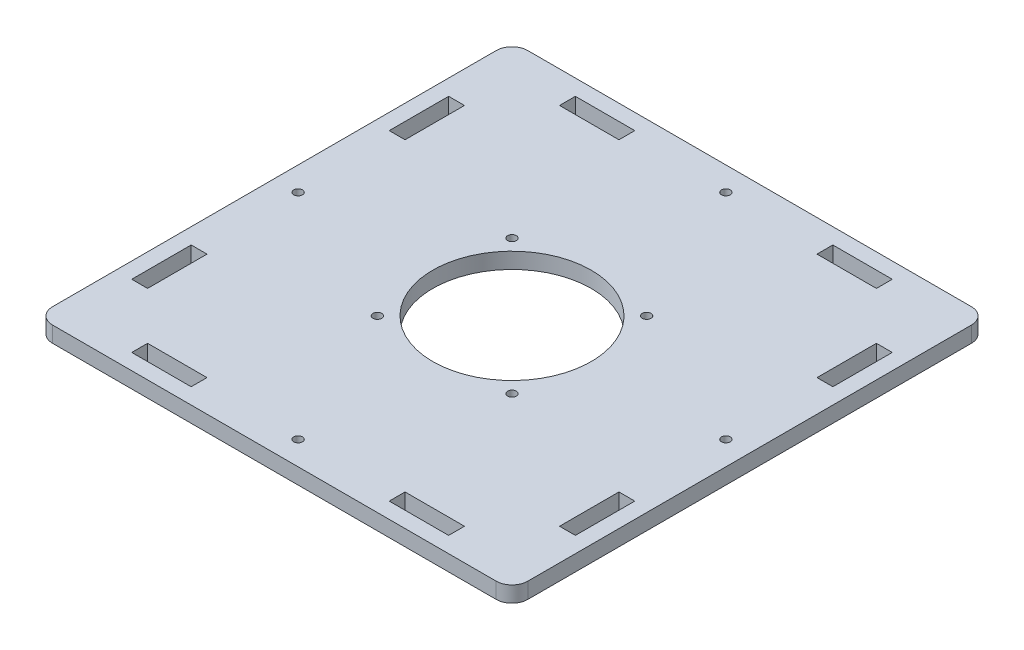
ISO-10303-21;
HEADER;
FILE_DESCRIPTION(('STEP AP214'),'2;1');
FILE_NAME('part.step','',(''),(''),'','','');
FILE_SCHEMA(('AUTOMOTIVE_DESIGN { 1 0 10303 214 1 1 1 1 }'));
ENDSEC;
DATA;
#1=APPLICATION_CONTEXT('core data for automotive mechanical design processes');
#2=APPLICATION_PROTOCOL_DEFINITION('international standard','automotive_design',2000,#1);
#3=PRODUCT_CONTEXT('',#1,'mechanical');
#4=PRODUCT('Part','Part','',(#3));
#5=PRODUCT_RELATED_PRODUCT_CATEGORY('part','',(#4));
#6=PRODUCT_DEFINITION_FORMATION('','',#4);
#7=PRODUCT_DEFINITION_CONTEXT('part definition',#1,'design');
#8=PRODUCT_DEFINITION('design','',#6,#7);
#9=PRODUCT_DEFINITION_SHAPE('','',#8);
#10=(LENGTH_UNIT() NAMED_UNIT(*) SI_UNIT(.MILLI.,.METRE.));
#11=(NAMED_UNIT(*) PLANE_ANGLE_UNIT() SI_UNIT($,.RADIAN.));
#12=(NAMED_UNIT(*) SI_UNIT($,.STERADIAN.) SOLID_ANGLE_UNIT());
#13=UNCERTAINTY_MEASURE_WITH_UNIT(LENGTH_MEASURE(1.E-05),#10,'distance_accuracy_value','');
#14=(GEOMETRIC_REPRESENTATION_CONTEXT(3) GLOBAL_UNCERTAINTY_ASSIGNED_CONTEXT((#13)) GLOBAL_UNIT_ASSIGNED_CONTEXT((#10,
#11,#12)) REPRESENTATION_CONTEXT('',''));
#15=CARTESIAN_POINT('',(0.,0.,0.));
#16=DIRECTION('',(0.,0.,1.));
#17=DIRECTION('',(1.,0.,0.));
#18=AXIS2_PLACEMENT_3D('',#15,#16,#17);
#19=CARTESIAN_POINT('',(-56.,4.,56.));
#20=DIRECTION('',(0.,1.,0.));
#21=DIRECTION('',(0.,0.,1.));
#22=AXIS2_PLACEMENT_3D('',#19,#20,#21);
#23=PLANE('',#22);
#24=CARTESIAN_POINT('',(0.,4.,54.));
#25=DIRECTION('',(0.,1.,0.));
#26=DIRECTION('',(0.,0.,1.));
#27=AXIS2_PLACEMENT_3D('',#24,#25,#26);
#28=CIRCLE('',#27,1.09999999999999);
#29=CARTESIAN_POINT('',(0.,4.,55.1));
#30=VERTEX_POINT('',#29);
#31=EDGE_CURVE('E727',#30,#30,#28,.T.);
#32=ORIENTED_EDGE('',*,*,#31,.F.);
#33=EDGE_LOOP('',(#32));
#34=FACE_BOUND('',#33,.T.);
#35=CARTESIAN_POINT('',(0.,4.,-54.));
#36=DIRECTION('',(0.,1.,0.));
#37=DIRECTION('',(0.,0.,1.));
#38=AXIS2_PLACEMENT_3D('',#35,#36,#37);
#39=CIRCLE('',#38,1.1);
#40=CARTESIAN_POINT('',(0.,4.,-52.9));
#41=VERTEX_POINT('',#40);
#42=EDGE_CURVE('E737',#41,#41,#39,.T.);
#43=ORIENTED_EDGE('',*,*,#42,.F.);
#44=EDGE_LOOP('',(#43));
#45=FACE_BOUND('',#44,.T.);
#46=CARTESIAN_POINT('',(17.,4.,17.));
#47=DIRECTION('',(0.,1.,0.));
#48=DIRECTION('',(0.,0.,1.));
#49=AXIS2_PLACEMENT_3D('',#46,#47,#48);
#50=CIRCLE('',#49,1.1);
#51=CARTESIAN_POINT('',(17.,4.,18.1));
#52=VERTEX_POINT('',#51);
#53=EDGE_CURVE('E328',#52,#52,#50,.T.);
#54=ORIENTED_EDGE('',*,*,#53,.F.);
#55=EDGE_LOOP('',(#54));
#56=FACE_BOUND('',#55,.T.);
#57=DIRECTION('',(0.,0.,-1.));
#58=VECTOR('',#57,1.);
#59=CARTESIAN_POINT('',(-52.0000000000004,4.,39.9999999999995));
#60=LINE('',#59,#58);
#61=CARTESIAN_POINT('',(-52.0000000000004,4.,39.9999999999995));
#62=VERTEX_POINT('',#61);
#63=CARTESIAN_POINT('',(-52.0000000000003,4.,24.9999999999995));
#64=VERTEX_POINT('',#63);
#65=EDGE_CURVE('E340',#62,#64,#60,.T.);
#66=ORIENTED_EDGE('',*,*,#65,.F.);
#67=DIRECTION('',(1.,0.,0.));
#68=VECTOR('',#67,1.);
#69=CARTESIAN_POINT('',(-56.0000000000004,4.,39.9999999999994));
#70=LINE('',#69,#68);
#71=CARTESIAN_POINT('',(-56.0000000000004,4.,39.9999999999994));
#72=VERTEX_POINT('',#71);
#73=EDGE_CURVE('E338',#72,#62,#70,.T.);
#74=ORIENTED_EDGE('',*,*,#73,.F.);
#75=DIRECTION('',(0.,0.,1.));
#76=VECTOR('',#75,1.);
#77=CARTESIAN_POINT('',(-56.0000000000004,4.,39.9999999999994));
#78=LINE('',#77,#76);
#79=CARTESIAN_POINT('',(-56.0000000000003,4.,24.9999999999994));
#80=VERTEX_POINT('',#79);
#81=EDGE_CURVE('E346',#80,#72,#78,.T.);
#82=ORIENTED_EDGE('',*,*,#81,.F.);
#83=DIRECTION('',(-1.,0.,0.));
#84=VECTOR('',#83,1.);
#85=CARTESIAN_POINT('',(-56.0000000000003,4.,24.9999999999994));
#86=LINE('',#85,#84);
#87=EDGE_CURVE('E343',#64,#80,#86,.T.);
#88=ORIENTED_EDGE('',*,*,#87,.F.);
#89=EDGE_LOOP('',(#66,#74,#82,#88));
#90=FACE_BOUND('',#89,.T.);
#91=DIRECTION('',(-1.,0.,0.));
#92=VECTOR('',#91,1.);
#93=CARTESIAN_POINT('',(39.9999999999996,4.,52.0000000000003));
#94=LINE('',#93,#92);
#95=CARTESIAN_POINT('',(39.9999999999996,4.,52.0000000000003));
#96=VERTEX_POINT('',#95);
#97=CARTESIAN_POINT('',(24.9999999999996,4.,52.0000000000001));
#98=VERTEX_POINT('',#97);
#99=EDGE_CURVE('E402',#96,#98,#94,.T.);
#100=ORIENTED_EDGE('',*,*,#99,.F.);
#101=DIRECTION('',(0.,0.,-1.));
#102=VECTOR('',#101,1.);
#103=CARTESIAN_POINT('',(39.9999999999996,4.,56.0000000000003));
#104=LINE('',#103,#102);
#105=CARTESIAN_POINT('',(39.9999999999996,4.,56.0000000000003));
#106=VERTEX_POINT('',#105);
#107=EDGE_CURVE('E400',#106,#96,#104,.T.);
#108=ORIENTED_EDGE('',*,*,#107,.F.);
#109=DIRECTION('',(1.,0.,0.));
#110=VECTOR('',#109,1.);
#111=CARTESIAN_POINT('',(39.9999999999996,4.,56.0000000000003));
#112=LINE('',#111,#110);
#113=CARTESIAN_POINT('',(24.9999999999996,4.,56.0000000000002));
#114=VERTEX_POINT('',#113);
#115=EDGE_CURVE('E408',#114,#106,#112,.T.);
#116=ORIENTED_EDGE('',*,*,#115,.F.);
#117=DIRECTION('',(0.,0.,1.));
#118=VECTOR('',#117,1.);
#119=CARTESIAN_POINT('',(24.9999999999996,4.,56.0000000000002));
#120=LINE('',#119,#118);
#121=EDGE_CURVE('E405',#98,#114,#120,.T.);
#122=ORIENTED_EDGE('',*,*,#121,.F.);
#123=EDGE_LOOP('',(#100,#108,#116,#122));
#124=FACE_BOUND('',#123,.T.);
#125=DIRECTION('',(0.,0.,1.));
#126=VECTOR('',#125,1.);
#127=CARTESIAN_POINT('',(52.0000000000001,4.,-39.9999999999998));
#128=LINE('',#127,#126);
#129=CARTESIAN_POINT('',(52.0000000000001,4.,-39.9999999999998));
#130=VERTEX_POINT('',#129);
#131=CARTESIAN_POINT('',(52.0000000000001,4.,-24.9999999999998));
#132=VERTEX_POINT('',#131);
#133=EDGE_CURVE('E464',#130,#132,#128,.T.);
#134=ORIENTED_EDGE('',*,*,#133,.F.);
#135=DIRECTION('',(-1.,0.,0.));
#136=VECTOR('',#135,1.);
#137=CARTESIAN_POINT('',(56.0000000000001,4.,-39.9999999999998));
#138=LINE('',#137,#136);
#139=CARTESIAN_POINT('',(56.0000000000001,4.,-39.9999999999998));
#140=VERTEX_POINT('',#139);
#141=EDGE_CURVE('E462',#140,#130,#138,.T.);
#142=ORIENTED_EDGE('',*,*,#141,.F.);
#143=DIRECTION('',(0.,0.,-1.));
#144=VECTOR('',#143,1.);
#145=CARTESIAN_POINT('',(56.0000000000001,4.,-39.9999999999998));
#146=LINE('',#145,#144);
#147=CARTESIAN_POINT('',(56.0000000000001,4.,-24.9999999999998));
#148=VERTEX_POINT('',#147);
#149=EDGE_CURVE('E470',#148,#140,#146,.T.);
#150=ORIENTED_EDGE('',*,*,#149,.F.);
#151=DIRECTION('',(1.,0.,0.));
#152=VECTOR('',#151,1.);
#153=CARTESIAN_POINT('',(56.0000000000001,4.,-24.9999999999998));
#154=LINE('',#153,#152);
#155=EDGE_CURVE('E467',#132,#148,#154,.T.);
#156=ORIENTED_EDGE('',*,*,#155,.F.);
#157=EDGE_LOOP('',(#134,#142,#150,#156));
#158=FACE_BOUND('',#157,.T.);
#159=DIRECTION('',(1.,0.,0.));
#160=VECTOR('',#159,1.);
#161=CARTESIAN_POINT('',(-40.,4.,-52.));
#162=LINE('',#161,#160);
#163=CARTESIAN_POINT('',(-40.,4.,-52.));
#164=VERTEX_POINT('',#163);
#165=CARTESIAN_POINT('',(-25.,4.,-52.));
#166=VERTEX_POINT('',#165);
#167=EDGE_CURVE('E526',#164,#166,#162,.T.);
#168=ORIENTED_EDGE('',*,*,#167,.F.);
#169=DIRECTION('',(0.,0.,1.));
#170=VECTOR('',#169,1.);
#171=CARTESIAN_POINT('',(-40.,4.,-56.));
#172=LINE('',#171,#170);
#173=CARTESIAN_POINT('',(-40.,4.,-56.));
#174=VERTEX_POINT('',#173);
#175=EDGE_CURVE('E524',#174,#164,#172,.T.);
#176=ORIENTED_EDGE('',*,*,#175,.F.);
#177=DIRECTION('',(-1.,0.,0.));
#178=VECTOR('',#177,1.);
#179=CARTESIAN_POINT('',(-40.,4.,-56.));
#180=LINE('',#179,#178);
#181=CARTESIAN_POINT('',(-25.,4.,-56.));
#182=VERTEX_POINT('',#181);
#183=EDGE_CURVE('E532',#182,#174,#180,.T.);
#184=ORIENTED_EDGE('',*,*,#183,.F.);
#185=DIRECTION('',(0.,0.,-1.));
#186=VECTOR('',#185,1.);
#187=CARTESIAN_POINT('',(-25.,4.,-56.));
#188=LINE('',#187,#186);
#189=EDGE_CURVE('E529',#166,#182,#188,.T.);
#190=ORIENTED_EDGE('',*,*,#189,.F.);
#191=EDGE_LOOP('',(#168,#176,#184,#190));
#192=FACE_BOUND('',#191,.T.);
#193=CARTESIAN_POINT('',(-17.,4.,-17.));
#194=DIRECTION('',(0.,1.,0.));
#195=DIRECTION('',(0.,0.,1.));
#196=AXIS2_PLACEMENT_3D('',#193,#194,#195);
#197=CIRCLE('',#196,1.1);
#198=CARTESIAN_POINT('',(-17.,4.,-15.9));
#199=VERTEX_POINT('',#198);
#200=EDGE_CURVE('E561',#199,#199,#197,.T.);
#201=ORIENTED_EDGE('',*,*,#200,.F.);
#202=EDGE_LOOP('',(#201));
#203=FACE_BOUND('',#202,.T.);
#204=CARTESIAN_POINT('',(-56.,4.,56.));
#205=DIRECTION('',(0.,1.,0.));
#206=DIRECTION('',(0.,0.,1.));
#207=AXIS2_PLACEMENT_3D('',#204,#205,#206);
#208=CIRCLE('',#207,4.00000000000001);
#209=CARTESIAN_POINT('',(-60.,4.,56.));
#210=VERTEX_POINT('',#209);
#211=CARTESIAN_POINT('',(-56.,4.,60.));
#212=VERTEX_POINT('',#211);
#213=EDGE_CURVE('E573',#210,#212,#208,.T.);
#214=ORIENTED_EDGE('',*,*,#213,.T.);
#215=DIRECTION('',(1.,0.,0.));
#216=VECTOR('',#215,1.);
#217=CARTESIAN_POINT('',(-56.,4.,60.));
#218=LINE('',#217,#216);
#219=CARTESIAN_POINT('',(56.,4.,60.));
#220=VERTEX_POINT('',#219);
#221=EDGE_CURVE('E576',#212,#220,#218,.T.);
#222=ORIENTED_EDGE('',*,*,#221,.T.);
#223=CARTESIAN_POINT('',(56.,4.,56.));
#224=DIRECTION('',(0.,1.,0.));
#225=DIRECTION('',(0.,0.,-1.));
#226=AXIS2_PLACEMENT_3D('',#223,#224,#225);
#227=CIRCLE('',#226,4.00000000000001);
#228=CARTESIAN_POINT('',(60.,4.,56.));
#229=VERTEX_POINT('',#228);
#230=EDGE_CURVE('E579',#220,#229,#227,.T.);
#231=ORIENTED_EDGE('',*,*,#230,.T.);
#232=DIRECTION('',(0.,0.,-1.));
#233=VECTOR('',#232,1.);
#234=CARTESIAN_POINT('',(60.,4.,-56.));
#235=LINE('',#234,#233);
#236=CARTESIAN_POINT('',(60.,4.,-56.));
#237=VERTEX_POINT('',#236);
#238=EDGE_CURVE('E581',#229,#237,#235,.T.);
#239=ORIENTED_EDGE('',*,*,#238,.T.);
#240=CARTESIAN_POINT('',(56.,4.,-56.));
#241=DIRECTION('',(0.,1.,0.));
#242=DIRECTION('',(0.,0.,-1.));
#243=AXIS2_PLACEMENT_3D('',#240,#241,#242);
#244=CIRCLE('',#243,4.00000000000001);
#245=CARTESIAN_POINT('',(56.,4.,-60.));
#246=VERTEX_POINT('',#245);
#247=EDGE_CURVE('E583',#237,#246,#244,.T.);
#248=ORIENTED_EDGE('',*,*,#247,.T.);
#249=DIRECTION('',(-1.,0.,0.));
#250=VECTOR('',#249,1.);
#251=CARTESIAN_POINT('',(-56.,4.,-60.));
#252=LINE('',#251,#250);
#253=CARTESIAN_POINT('',(-56.,4.,-60.));
#254=VERTEX_POINT('',#253);
#255=EDGE_CURVE('E585',#246,#254,#252,.T.);
#256=ORIENTED_EDGE('',*,*,#255,.T.);
#257=CARTESIAN_POINT('',(-56.,4.,-56.));
#258=DIRECTION('',(0.,1.,0.));
#259=DIRECTION('',(0.,0.,1.));
#260=AXIS2_PLACEMENT_3D('',#257,#258,#259);
#261=CIRCLE('',#260,4.00000000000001);
#262=CARTESIAN_POINT('',(-60.,4.,-56.));
#263=VERTEX_POINT('',#262);
#264=EDGE_CURVE('E587',#254,#263,#261,.T.);
#265=ORIENTED_EDGE('',*,*,#264,.T.);
#266=DIRECTION('',(0.,0.,1.));
#267=VECTOR('',#266,1.);
#268=CARTESIAN_POINT('',(-60.,4.,-56.));
#269=LINE('',#268,#267);
#270=EDGE_CURVE('E589',#263,#210,#269,.T.);
#271=ORIENTED_EDGE('',*,*,#270,.T.);
#272=EDGE_LOOP('',(#214,#222,#231,#239,#248,#256,#265,#271));
#273=FACE_BOUND('',#272,.T.);
#274=CARTESIAN_POINT('',(0.,4.,0.));
#275=DIRECTION('',(0.,1.,0.));
#276=DIRECTION('',(0.,0.,1.));
#277=AXIS2_PLACEMENT_3D('',#274,#275,#276);
#278=CIRCLE('',#277,20.);
#279=CARTESIAN_POINT('',(0.,4.,20.));
#280=VERTEX_POINT('',#279);
#281=EDGE_CURVE('E567',#280,#280,#278,.T.);
#282=ORIENTED_EDGE('',*,*,#281,.F.);
#283=EDGE_LOOP('',(#282));
#284=FACE_BOUND('',#283,.T.);
#285=CARTESIAN_POINT('',(17.,4.,-17.));
#286=DIRECTION('',(0.,1.,0.));
#287=DIRECTION('',(0.,0.,-1.));
#288=AXIS2_PLACEMENT_3D('',#285,#286,#287);
#289=CIRCLE('',#288,1.1);
#290=CARTESIAN_POINT('',(17.,4.,-18.1));
#291=VERTEX_POINT('',#290);
#292=EDGE_CURVE('E555',#291,#291,#289,.T.);
#293=ORIENTED_EDGE('',*,*,#292,.F.);
#294=EDGE_LOOP('',(#293));
#295=FACE_BOUND('',#294,.T.);
#296=DIRECTION('',(0.,0.,1.));
#297=VECTOR('',#296,1.);
#298=CARTESIAN_POINT('',(25.,4.,-56.));
#299=LINE('',#298,#297);
#300=CARTESIAN_POINT('',(25.,4.,-56.));
#301=VERTEX_POINT('',#300);
#302=CARTESIAN_POINT('',(25.,4.,-52.));
#303=VERTEX_POINT('',#302);
#304=EDGE_CURVE('E495',#301,#303,#299,.T.);
#305=ORIENTED_EDGE('',*,*,#304,.F.);
#306=DIRECTION('',(-1.,0.,0.));
#307=VECTOR('',#306,1.);
#308=CARTESIAN_POINT('',(40.,4.,-56.));
#309=LINE('',#308,#307);
#310=CARTESIAN_POINT('',(40.,4.,-56.));
#311=VERTEX_POINT('',#310);
#312=EDGE_CURVE('E493',#311,#301,#309,.T.);
#313=ORIENTED_EDGE('',*,*,#312,.F.);
#314=DIRECTION('',(0.,0.,-1.));
#315=VECTOR('',#314,1.);
#316=CARTESIAN_POINT('',(40.,4.,-56.));
#317=LINE('',#316,#315);
#318=CARTESIAN_POINT('',(40.,4.,-52.));
#319=VERTEX_POINT('',#318);
#320=EDGE_CURVE('E501',#319,#311,#317,.T.);
#321=ORIENTED_EDGE('',*,*,#320,.F.);
#322=DIRECTION('',(1.,0.,0.));
#323=VECTOR('',#322,1.);
#324=CARTESIAN_POINT('',(40.,4.,-52.));
#325=LINE('',#324,#323);
#326=EDGE_CURVE('E498',#303,#319,#325,.T.);
#327=ORIENTED_EDGE('',*,*,#326,.F.);
#328=EDGE_LOOP('',(#305,#313,#321,#327));
#329=FACE_BOUND('',#328,.T.);
#330=DIRECTION('',(-1.,0.,0.));
#331=VECTOR('',#330,1.);
#332=CARTESIAN_POINT('',(55.9999999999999,4.,25.0000000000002));
#333=LINE('',#332,#331);
#334=CARTESIAN_POINT('',(55.9999999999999,4.,25.0000000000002));
#335=VERTEX_POINT('',#334);
#336=CARTESIAN_POINT('',(51.9999999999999,4.,25.0000000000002));
#337=VERTEX_POINT('',#336);
#338=EDGE_CURVE('E433',#335,#337,#333,.T.);
#339=ORIENTED_EDGE('',*,*,#338,.F.);
#340=DIRECTION('',(0.,0.,-1.));
#341=VECTOR('',#340,1.);
#342=CARTESIAN_POINT('',(55.9999999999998,4.,40.0000000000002));
#343=LINE('',#342,#341);
#344=CARTESIAN_POINT('',(55.9999999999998,4.,40.0000000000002));
#345=VERTEX_POINT('',#344);
#346=EDGE_CURVE('E431',#345,#335,#343,.T.);
#347=ORIENTED_EDGE('',*,*,#346,.F.);
#348=DIRECTION('',(1.,0.,0.));
#349=VECTOR('',#348,1.);
#350=CARTESIAN_POINT('',(55.9999999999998,4.,40.0000000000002));
#351=LINE('',#350,#349);
#352=CARTESIAN_POINT('',(51.9999999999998,4.,40.0000000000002));
#353=VERTEX_POINT('',#352);
#354=EDGE_CURVE('E439',#353,#345,#351,.T.);
#355=ORIENTED_EDGE('',*,*,#354,.F.);
#356=DIRECTION('',(0.,0.,1.));
#357=VECTOR('',#356,1.);
#358=CARTESIAN_POINT('',(51.9999999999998,4.,40.0000000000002));
#359=LINE('',#358,#357);
#360=EDGE_CURVE('E436',#337,#353,#359,.T.);
#361=ORIENTED_EDGE('',*,*,#360,.F.);
#362=EDGE_LOOP('',(#339,#347,#355,#361));
#363=FACE_BOUND('',#362,.T.);
#364=DIRECTION('',(0.,0.,-1.));
#365=VECTOR('',#364,1.);
#366=CARTESIAN_POINT('',(-25.0000000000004,4.,55.9999999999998));
#367=LINE('',#366,#365);
#368=CARTESIAN_POINT('',(-25.0000000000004,4.,55.9999999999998));
#369=VERTEX_POINT('',#368);
#370=CARTESIAN_POINT('',(-25.0000000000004,4.,51.9999999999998));
#371=VERTEX_POINT('',#370);
#372=EDGE_CURVE('E371',#369,#371,#367,.T.);
#373=ORIENTED_EDGE('',*,*,#372,.F.);
#374=DIRECTION('',(1.,0.,0.));
#375=VECTOR('',#374,1.);
#376=CARTESIAN_POINT('',(-40.0000000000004,4.,55.9999999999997));
#377=LINE('',#376,#375);
#378=CARTESIAN_POINT('',(-40.0000000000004,4.,55.9999999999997));
#379=VERTEX_POINT('',#378);
#380=EDGE_CURVE('E369',#379,#369,#377,.T.);
#381=ORIENTED_EDGE('',*,*,#380,.F.);
#382=DIRECTION('',(0.,0.,1.));
#383=VECTOR('',#382,1.);
#384=CARTESIAN_POINT('',(-40.0000000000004,4.,55.9999999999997));
#385=LINE('',#384,#383);
#386=CARTESIAN_POINT('',(-40.0000000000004,4.,51.9999999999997));
#387=VERTEX_POINT('',#386);
#388=EDGE_CURVE('E377',#387,#379,#385,.T.);
#389=ORIENTED_EDGE('',*,*,#388,.F.);
#390=DIRECTION('',(-1.,0.,0.));
#391=VECTOR('',#390,1.);
#392=CARTESIAN_POINT('',(-40.0000000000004,4.,51.9999999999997));
#393=LINE('',#392,#391);
#394=EDGE_CURVE('E374',#371,#387,#393,.T.);
#395=ORIENTED_EDGE('',*,*,#394,.F.);
#396=EDGE_LOOP('',(#373,#381,#389,#395));
#397=FACE_BOUND('',#396,.T.);
#398=DIRECTION('',(1.,0.,0.));
#399=VECTOR('',#398,1.);
#400=CARTESIAN_POINT('',(-55.9999999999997,4.,-25.0000000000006));
#401=LINE('',#400,#399);
#402=CARTESIAN_POINT('',(-55.9999999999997,4.,-25.0000000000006));
#403=VERTEX_POINT('',#402);
#404=CARTESIAN_POINT('',(-51.9999999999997,4.,-25.0000000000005));
#405=VERTEX_POINT('',#404);
#406=EDGE_CURVE('E307',#403,#405,#401,.T.);
#407=ORIENTED_EDGE('',*,*,#406,.F.);
#408=DIRECTION('',(0.,0.,1.));
#409=VECTOR('',#408,1.);
#410=CARTESIAN_POINT('',(-55.9999999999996,4.,-40.0000000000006));
#411=LINE('',#410,#409);
#412=CARTESIAN_POINT('',(-55.9999999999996,4.,-40.0000000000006));
#413=VERTEX_POINT('',#412);
#414=EDGE_CURVE('E299',#413,#403,#411,.T.);
#415=ORIENTED_EDGE('',*,*,#414,.F.);
#416=DIRECTION('',(-1.,0.,0.));
#417=VECTOR('',#416,1.);
#418=CARTESIAN_POINT('',(-55.9999999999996,4.,-40.0000000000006));
#419=LINE('',#418,#417);
#420=CARTESIAN_POINT('',(-51.9999999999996,4.,-40.0000000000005));
#421=VERTEX_POINT('',#420);
#422=EDGE_CURVE('E322',#421,#413,#419,.T.);
#423=ORIENTED_EDGE('',*,*,#422,.F.);
#424=DIRECTION('',(0.,0.,-1.));
#425=VECTOR('',#424,1.);
#426=CARTESIAN_POINT('',(-51.9999999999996,4.,-40.0000000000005));
#427=LINE('',#426,#425);
#428=EDGE_CURVE('E320',#405,#421,#427,.T.);
#429=ORIENTED_EDGE('',*,*,#428,.F.);
#430=EDGE_LOOP('',(#407,#415,#423,#429));
#431=FACE_BOUND('',#430,.T.);
#432=CARTESIAN_POINT('',(-17.,4.,17.));
#433=DIRECTION('',(0.,1.,0.));
#434=DIRECTION('',(0.,0.,-1.));
#435=AXIS2_PLACEMENT_3D('',#432,#433,#434);
#436=CIRCLE('',#435,1.1);
#437=CARTESIAN_POINT('',(-17.,4.,15.9));
#438=VERTEX_POINT('',#437);
#439=EDGE_CURVE('E742',#438,#438,#436,.T.);
#440=ORIENTED_EDGE('',*,*,#439,.F.);
#441=EDGE_LOOP('',(#440));
#442=FACE_BOUND('',#441,.T.);
#443=CARTESIAN_POINT('',(54.,4.,0.));
#444=DIRECTION('',(0.,1.,0.));
#445=DIRECTION('',(0.,0.,1.));
#446=AXIS2_PLACEMENT_3D('',#443,#444,#445);
#447=CIRCLE('',#446,1.10000000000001);
#448=CARTESIAN_POINT('',(54.,4.,1.1));
#449=VERTEX_POINT('',#448);
#450=EDGE_CURVE('E732',#449,#449,#447,.T.);
#451=ORIENTED_EDGE('',*,*,#450,.F.);
#452=EDGE_LOOP('',(#451));
#453=FACE_BOUND('',#452,.T.);
#454=CARTESIAN_POINT('',(-54.,4.,0.));
#455=DIRECTION('',(0.,1.,0.));
#456=DIRECTION('',(0.,0.,1.));
#457=AXIS2_PLACEMENT_3D('',#454,#455,#456);
#458=CIRCLE('',#457,1.1);
#459=CARTESIAN_POINT('',(-54.,4.,1.10000000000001));
#460=VERTEX_POINT('',#459);
#461=EDGE_CURVE('E721',#460,#460,#458,.T.);
#462=ORIENTED_EDGE('',*,*,#461,.F.);
#463=EDGE_LOOP('',(#462));
#464=FACE_BOUND('',#463,.T.);
#465=ADVANCED_FACE('F42',(#34,#45,#56,#90,#124,#158,#192,#203,#273,#284,#295,#329,#363,#397,
#431,#442,#453,#464),#23,.T.);
#466=CARTESIAN_POINT('',(-56.,0.,56.));
#467=DIRECTION('',(0.,1.,0.));
#468=DIRECTION('',(0.,0.,1.));
#469=AXIS2_PLACEMENT_3D('',#466,#467,#468);
#470=PLANE('',#469);
#471=CARTESIAN_POINT('',(0.,0.,54.));
#472=DIRECTION('',(0.,1.,0.));
#473=DIRECTION('',(0.,0.,1.));
#474=AXIS2_PLACEMENT_3D('',#471,#472,#473);
#475=CIRCLE('',#474,1.09999999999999);
#476=CARTESIAN_POINT('',(0.,0.,55.1));
#477=VERTEX_POINT('',#476);
#478=EDGE_CURVE('E724',#477,#477,#475,.T.);
#479=ORIENTED_EDGE('',*,*,#478,.T.);
#480=EDGE_LOOP('',(#479));
#481=FACE_BOUND('',#480,.T.);
#482=CARTESIAN_POINT('',(0.,0.,-54.));
#483=DIRECTION('',(0.,1.,0.));
#484=DIRECTION('',(0.,0.,1.));
#485=AXIS2_PLACEMENT_3D('',#482,#483,#484);
#486=CIRCLE('',#485,1.1);
#487=CARTESIAN_POINT('',(0.,0.,-52.9));
#488=VERTEX_POINT('',#487);
#489=EDGE_CURVE('E735',#488,#488,#486,.T.);
#490=ORIENTED_EDGE('',*,*,#489,.T.);
#491=EDGE_LOOP('',(#490));
#492=FACE_BOUND('',#491,.T.);
#493=CARTESIAN_POINT('',(17.,0.,17.));
#494=DIRECTION('',(0.,1.,0.));
#495=DIRECTION('',(0.,0.,1.));
#496=AXIS2_PLACEMENT_3D('',#493,#494,#495);
#497=CIRCLE('',#496,1.1);
#498=CARTESIAN_POINT('',(17.,0.,18.1));
#499=VERTEX_POINT('',#498);
#500=EDGE_CURVE('E745',#499,#499,#497,.T.);
#501=ORIENTED_EDGE('',*,*,#500,.T.);
#502=EDGE_LOOP('',(#501));
#503=FACE_BOUND('',#502,.T.);
#504=DIRECTION('',(1.,0.,0.));
#505=VECTOR('',#504,1.);
#506=CARTESIAN_POINT('',(-56.0000000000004,0.,39.9999999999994));
#507=LINE('',#506,#505);
#508=CARTESIAN_POINT('',(-56.0000000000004,0.,39.9999999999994));
#509=VERTEX_POINT('',#508);
#510=CARTESIAN_POINT('',(-52.0000000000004,0.,39.9999999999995));
#511=VERTEX_POINT('',#510);
#512=EDGE_CURVE('E315',#509,#511,#507,.T.);
#513=ORIENTED_EDGE('',*,*,#512,.T.);
#514=DIRECTION('',(0.,0.,-1.));
#515=VECTOR('',#514,1.);
#516=CARTESIAN_POINT('',(-52.0000000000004,0.,39.9999999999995));
#517=LINE('',#516,#515);
#518=CARTESIAN_POINT('',(-52.0000000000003,0.,24.9999999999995));
#519=VERTEX_POINT('',#518);
#520=EDGE_CURVE('E351',#511,#519,#517,.T.);
#521=ORIENTED_EDGE('',*,*,#520,.T.);
#522=DIRECTION('',(-1.,0.,0.));
#523=VECTOR('',#522,1.);
#524=CARTESIAN_POINT('',(-56.0000000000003,0.,24.9999999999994));
#525=LINE('',#524,#523);
#526=CARTESIAN_POINT('',(-56.0000000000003,0.,24.9999999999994));
#527=VERTEX_POINT('',#526);
#528=EDGE_CURVE('E354',#519,#527,#525,.T.);
#529=ORIENTED_EDGE('',*,*,#528,.T.);
#530=DIRECTION('',(0.,0.,1.));
#531=VECTOR('',#530,1.);
#532=CARTESIAN_POINT('',(-56.0000000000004,0.,39.9999999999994));
#533=LINE('',#532,#531);
#534=EDGE_CURVE('E341',#527,#509,#533,.T.);
#535=ORIENTED_EDGE('',*,*,#534,.T.);
#536=EDGE_LOOP('',(#513,#521,#529,#535));
#537=FACE_BOUND('',#536,.T.);
#538=DIRECTION('',(0.,0.,-1.));
#539=VECTOR('',#538,1.);
#540=CARTESIAN_POINT('',(39.9999999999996,0.,56.0000000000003));
#541=LINE('',#540,#539);
#542=CARTESIAN_POINT('',(39.9999999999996,0.,56.0000000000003));
#543=VERTEX_POINT('',#542);
#544=CARTESIAN_POINT('',(39.9999999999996,0.,52.0000000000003));
#545=VERTEX_POINT('',#544);
#546=EDGE_CURVE('E399',#543,#545,#541,.T.);
#547=ORIENTED_EDGE('',*,*,#546,.T.);
#548=DIRECTION('',(-1.,0.,0.));
#549=VECTOR('',#548,1.);
#550=CARTESIAN_POINT('',(39.9999999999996,0.,52.0000000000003));
#551=LINE('',#550,#549);
#552=CARTESIAN_POINT('',(24.9999999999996,0.,52.0000000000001));
#553=VERTEX_POINT('',#552);
#554=EDGE_CURVE('E413',#545,#553,#551,.T.);
#555=ORIENTED_EDGE('',*,*,#554,.T.);
#556=DIRECTION('',(0.,0.,1.));
#557=VECTOR('',#556,1.);
#558=CARTESIAN_POINT('',(24.9999999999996,0.,56.0000000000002));
#559=LINE('',#558,#557);
#560=CARTESIAN_POINT('',(24.9999999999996,0.,56.0000000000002));
#561=VERTEX_POINT('',#560);
#562=EDGE_CURVE('E416',#553,#561,#559,.T.);
#563=ORIENTED_EDGE('',*,*,#562,.T.);
#564=DIRECTION('',(1.,0.,0.));
#565=VECTOR('',#564,1.);
#566=CARTESIAN_POINT('',(39.9999999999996,0.,56.0000000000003));
#567=LINE('',#566,#565);
#568=EDGE_CURVE('E403',#561,#543,#567,.T.);
#569=ORIENTED_EDGE('',*,*,#568,.T.);
#570=EDGE_LOOP('',(#547,#555,#563,#569));
#571=FACE_BOUND('',#570,.T.);
#572=DIRECTION('',(-1.,0.,0.));
#573=VECTOR('',#572,1.);
#574=CARTESIAN_POINT('',(56.0000000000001,0.,-39.9999999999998));
#575=LINE('',#574,#573);
#576=CARTESIAN_POINT('',(56.0000000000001,0.,-39.9999999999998));
#577=VERTEX_POINT('',#576);
#578=CARTESIAN_POINT('',(52.0000000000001,0.,-39.9999999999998));
#579=VERTEX_POINT('',#578);
#580=EDGE_CURVE('E461',#577,#579,#575,.T.);
#581=ORIENTED_EDGE('',*,*,#580,.T.);
#582=DIRECTION('',(0.,0.,1.));
#583=VECTOR('',#582,1.);
#584=CARTESIAN_POINT('',(52.0000000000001,0.,-39.9999999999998));
#585=LINE('',#584,#583);
#586=CARTESIAN_POINT('',(52.0000000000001,0.,-24.9999999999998));
#587=VERTEX_POINT('',#586);
#588=EDGE_CURVE('E475',#579,#587,#585,.T.);
#589=ORIENTED_EDGE('',*,*,#588,.T.);
#590=DIRECTION('',(1.,0.,0.));
#591=VECTOR('',#590,1.);
#592=CARTESIAN_POINT('',(56.0000000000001,0.,-24.9999999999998));
#593=LINE('',#592,#591);
#594=CARTESIAN_POINT('',(56.0000000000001,0.,-24.9999999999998));
#595=VERTEX_POINT('',#594);
#596=EDGE_CURVE('E478',#587,#595,#593,.T.);
#597=ORIENTED_EDGE('',*,*,#596,.T.);
#598=DIRECTION('',(0.,0.,-1.));
#599=VECTOR('',#598,1.);
#600=CARTESIAN_POINT('',(56.0000000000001,0.,-39.9999999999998));
#601=LINE('',#600,#599);
#602=EDGE_CURVE('E465',#595,#577,#601,.T.);
#603=ORIENTED_EDGE('',*,*,#602,.T.);
#604=EDGE_LOOP('',(#581,#589,#597,#603));
#605=FACE_BOUND('',#604,.T.);
#606=DIRECTION('',(0.,0.,1.));
#607=VECTOR('',#606,1.);
#608=CARTESIAN_POINT('',(-40.,0.,-56.));
#609=LINE('',#608,#607);
#610=CARTESIAN_POINT('',(-40.,0.,-56.));
#611=VERTEX_POINT('',#610);
#612=CARTESIAN_POINT('',(-40.,0.,-52.));
#613=VERTEX_POINT('',#612);
#614=EDGE_CURVE('E523',#611,#613,#609,.T.);
#615=ORIENTED_EDGE('',*,*,#614,.T.);
#616=DIRECTION('',(1.,0.,0.));
#617=VECTOR('',#616,1.);
#618=CARTESIAN_POINT('',(-40.,0.,-52.));
#619=LINE('',#618,#617);
#620=CARTESIAN_POINT('',(-25.,0.,-52.));
#621=VERTEX_POINT('',#620);
#622=EDGE_CURVE('E537',#613,#621,#619,.T.);
#623=ORIENTED_EDGE('',*,*,#622,.T.);
#624=DIRECTION('',(0.,0.,-1.));
#625=VECTOR('',#624,1.);
#626=CARTESIAN_POINT('',(-25.,0.,-56.));
#627=LINE('',#626,#625);
#628=CARTESIAN_POINT('',(-25.,0.,-56.));
#629=VERTEX_POINT('',#628);
#630=EDGE_CURVE('E540',#621,#629,#627,.T.);
#631=ORIENTED_EDGE('',*,*,#630,.T.);
#632=DIRECTION('',(-1.,0.,0.));
#633=VECTOR('',#632,1.);
#634=CARTESIAN_POINT('',(-40.,0.,-56.));
#635=LINE('',#634,#633);
#636=EDGE_CURVE('E527',#629,#611,#635,.T.);
#637=ORIENTED_EDGE('',*,*,#636,.T.);
#638=EDGE_LOOP('',(#615,#623,#631,#637));
#639=FACE_BOUND('',#638,.T.);
#640=CARTESIAN_POINT('',(-17.,0.,-17.));
#641=DIRECTION('',(0.,1.,0.));
#642=DIRECTION('',(0.,0.,1.));
#643=AXIS2_PLACEMENT_3D('',#640,#641,#642);
#644=CIRCLE('',#643,1.1);
#645=CARTESIAN_POINT('',(-17.,0.,-15.9));
#646=VERTEX_POINT('',#645);
#647=EDGE_CURVE('E558',#646,#646,#644,.T.);
#648=ORIENTED_EDGE('',*,*,#647,.T.);
#649=EDGE_LOOP('',(#648));
#650=FACE_BOUND('',#649,.T.);
#651=CARTESIAN_POINT('',(-56.,0.,56.));
#652=DIRECTION('',(0.,1.,0.));
#653=DIRECTION('',(0.,0.,1.));
#654=AXIS2_PLACEMENT_3D('',#651,#652,#653);
#655=CIRCLE('',#654,4.00000000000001);
#656=CARTESIAN_POINT('',(-60.,0.,56.));
#657=VERTEX_POINT('',#656);
#658=CARTESIAN_POINT('',(-56.,0.,60.));
#659=VERTEX_POINT('',#658);
#660=EDGE_CURVE('E570',#657,#659,#655,.T.);
#661=ORIENTED_EDGE('',*,*,#660,.F.);
#662=DIRECTION('',(0.,0.,1.));
#663=VECTOR('',#662,1.);
#664=CARTESIAN_POINT('',(-60.,0.,-56.));
#665=LINE('',#664,#663);
#666=CARTESIAN_POINT('',(-60.,0.,-56.));
#667=VERTEX_POINT('',#666);
#668=EDGE_CURVE('E577',#667,#657,#665,.T.);
#669=ORIENTED_EDGE('',*,*,#668,.F.);
#670=CARTESIAN_POINT('',(-56.,0.,-56.));
#671=DIRECTION('',(0.,1.,0.));
#672=DIRECTION('',(0.,0.,1.));
#673=AXIS2_PLACEMENT_3D('',#670,#671,#672);
#674=CIRCLE('',#673,4.00000000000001);
#675=CARTESIAN_POINT('',(-56.,0.,-60.));
#676=VERTEX_POINT('',#675);
#677=EDGE_CURVE('E604',#676,#667,#674,.T.);
#678=ORIENTED_EDGE('',*,*,#677,.F.);
#679=DIRECTION('',(-1.,0.,0.));
#680=VECTOR('',#679,1.);
#681=CARTESIAN_POINT('',(-56.,0.,-60.));
#682=LINE('',#681,#680);
#683=CARTESIAN_POINT('',(56.,0.,-60.));
#684=VERTEX_POINT('',#683);
#685=EDGE_CURVE('E602',#684,#676,#682,.T.);
#686=ORIENTED_EDGE('',*,*,#685,.F.);
#687=CARTESIAN_POINT('',(56.,0.,-56.));
#688=DIRECTION('',(0.,1.,0.));
#689=DIRECTION('',(0.,0.,-1.));
#690=AXIS2_PLACEMENT_3D('',#687,#688,#689);
#691=CIRCLE('',#690,4.00000000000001);
#692=CARTESIAN_POINT('',(60.,0.,-56.));
#693=VERTEX_POINT('',#692);
#694=EDGE_CURVE('E600',#693,#684,#691,.T.);
#695=ORIENTED_EDGE('',*,*,#694,.F.);
#696=DIRECTION('',(0.,0.,-1.));
#697=VECTOR('',#696,1.);
#698=CARTESIAN_POINT('',(60.,0.,-56.));
#699=LINE('',#698,#697);
#700=CARTESIAN_POINT('',(60.,0.,56.));
#701=VERTEX_POINT('',#700);
#702=EDGE_CURVE('E598',#701,#693,#699,.T.);
#703=ORIENTED_EDGE('',*,*,#702,.F.);
#704=CARTESIAN_POINT('',(56.,0.,56.));
#705=DIRECTION('',(0.,1.,0.));
#706=DIRECTION('',(0.,0.,-1.));
#707=AXIS2_PLACEMENT_3D('',#704,#705,#706);
#708=CIRCLE('',#707,4.00000000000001);
#709=CARTESIAN_POINT('',(56.,0.,60.));
#710=VERTEX_POINT('',#709);
#711=EDGE_CURVE('E596',#710,#701,#708,.T.);
#712=ORIENTED_EDGE('',*,*,#711,.F.);
#713=DIRECTION('',(1.,0.,0.));
#714=VECTOR('',#713,1.);
#715=CARTESIAN_POINT('',(-56.,0.,60.));
#716=LINE('',#715,#714);
#717=EDGE_CURVE('E594',#659,#710,#716,.T.);
#718=ORIENTED_EDGE('',*,*,#717,.F.);
#719=EDGE_LOOP('',(#661,#669,#678,#686,#695,#703,#712,#718));
#720=FACE_BOUND('',#719,.T.);
#721=CARTESIAN_POINT('',(0.,0.,0.));
#722=DIRECTION('',(0.,1.,0.));
#723=DIRECTION('',(0.,0.,1.));
#724=AXIS2_PLACEMENT_3D('',#721,#722,#723);
#725=CIRCLE('',#724,20.);
#726=CARTESIAN_POINT('',(0.,0.,20.));
#727=VERTEX_POINT('',#726);
#728=EDGE_CURVE('E564',#727,#727,#725,.T.);
#729=ORIENTED_EDGE('',*,*,#728,.T.);
#730=EDGE_LOOP('',(#729));
#731=FACE_BOUND('',#730,.T.);
#732=CARTESIAN_POINT('',(17.,0.,-17.));
#733=DIRECTION('',(0.,1.,0.));
#734=DIRECTION('',(0.,0.,-1.));
#735=AXIS2_PLACEMENT_3D('',#732,#733,#734);
#736=CIRCLE('',#735,1.1);
#737=CARTESIAN_POINT('',(17.,0.,-18.1));
#738=VERTEX_POINT('',#737);
#739=EDGE_CURVE('E554',#738,#738,#736,.T.);
#740=ORIENTED_EDGE('',*,*,#739,.T.);
#741=EDGE_LOOP('',(#740));
#742=FACE_BOUND('',#741,.T.);
#743=DIRECTION('',(-1.,0.,0.));
#744=VECTOR('',#743,1.);
#745=CARTESIAN_POINT('',(40.,0.,-56.));
#746=LINE('',#745,#744);
#747=CARTESIAN_POINT('',(40.,0.,-56.));
#748=VERTEX_POINT('',#747);
#749=CARTESIAN_POINT('',(25.,0.,-56.));
#750=VERTEX_POINT('',#749);
#751=EDGE_CURVE('E492',#748,#750,#746,.T.);
#752=ORIENTED_EDGE('',*,*,#751,.T.);
#753=DIRECTION('',(0.,0.,1.));
#754=VECTOR('',#753,1.);
#755=CARTESIAN_POINT('',(25.,0.,-56.));
#756=LINE('',#755,#754);
#757=CARTESIAN_POINT('',(25.,0.,-52.));
#758=VERTEX_POINT('',#757);
#759=EDGE_CURVE('E506',#750,#758,#756,.T.);
#760=ORIENTED_EDGE('',*,*,#759,.T.);
#761=DIRECTION('',(1.,0.,0.));
#762=VECTOR('',#761,1.);
#763=CARTESIAN_POINT('',(40.,0.,-52.));
#764=LINE('',#763,#762);
#765=CARTESIAN_POINT('',(40.,0.,-52.));
#766=VERTEX_POINT('',#765);
#767=EDGE_CURVE('E509',#758,#766,#764,.T.);
#768=ORIENTED_EDGE('',*,*,#767,.T.);
#769=DIRECTION('',(0.,0.,-1.));
#770=VECTOR('',#769,1.);
#771=CARTESIAN_POINT('',(40.,0.,-56.));
#772=LINE('',#771,#770);
#773=EDGE_CURVE('E496',#766,#748,#772,.T.);
#774=ORIENTED_EDGE('',*,*,#773,.T.);
#775=EDGE_LOOP('',(#752,#760,#768,#774));
#776=FACE_BOUND('',#775,.T.);
#777=DIRECTION('',(0.,0.,-1.));
#778=VECTOR('',#777,1.);
#779=CARTESIAN_POINT('',(55.9999999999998,0.,40.0000000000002));
#780=LINE('',#779,#778);
#781=CARTESIAN_POINT('',(55.9999999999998,0.,40.0000000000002));
#782=VERTEX_POINT('',#781);
#783=CARTESIAN_POINT('',(55.9999999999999,0.,25.0000000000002));
#784=VERTEX_POINT('',#783);
#785=EDGE_CURVE('E430',#782,#784,#780,.T.);
#786=ORIENTED_EDGE('',*,*,#785,.T.);
#787=DIRECTION('',(-1.,0.,0.));
#788=VECTOR('',#787,1.);
#789=CARTESIAN_POINT('',(55.9999999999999,0.,25.0000000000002));
#790=LINE('',#789,#788);
#791=CARTESIAN_POINT('',(51.9999999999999,0.,25.0000000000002));
#792=VERTEX_POINT('',#791);
#793=EDGE_CURVE('E444',#784,#792,#790,.T.);
#794=ORIENTED_EDGE('',*,*,#793,.T.);
#795=DIRECTION('',(0.,0.,1.));
#796=VECTOR('',#795,1.);
#797=CARTESIAN_POINT('',(51.9999999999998,0.,40.0000000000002));
#798=LINE('',#797,#796);
#799=CARTESIAN_POINT('',(51.9999999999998,0.,40.0000000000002));
#800=VERTEX_POINT('',#799);
#801=EDGE_CURVE('E447',#792,#800,#798,.T.);
#802=ORIENTED_EDGE('',*,*,#801,.T.);
#803=DIRECTION('',(1.,0.,0.));
#804=VECTOR('',#803,1.);
#805=CARTESIAN_POINT('',(55.9999999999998,0.,40.0000000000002));
#806=LINE('',#805,#804);
#807=EDGE_CURVE('E434',#800,#782,#806,.T.);
#808=ORIENTED_EDGE('',*,*,#807,.T.);
#809=EDGE_LOOP('',(#786,#794,#802,#808));
#810=FACE_BOUND('',#809,.T.);
#811=DIRECTION('',(1.,0.,0.));
#812=VECTOR('',#811,1.);
#813=CARTESIAN_POINT('',(-40.0000000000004,0.,55.9999999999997));
#814=LINE('',#813,#812);
#815=CARTESIAN_POINT('',(-40.0000000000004,0.,55.9999999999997));
#816=VERTEX_POINT('',#815);
#817=CARTESIAN_POINT('',(-25.0000000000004,0.,55.9999999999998));
#818=VERTEX_POINT('',#817);
#819=EDGE_CURVE('E368',#816,#818,#814,.T.);
#820=ORIENTED_EDGE('',*,*,#819,.T.);
#821=DIRECTION('',(0.,0.,-1.));
#822=VECTOR('',#821,1.);
#823=CARTESIAN_POINT('',(-25.0000000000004,0.,55.9999999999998));
#824=LINE('',#823,#822);
#825=CARTESIAN_POINT('',(-25.0000000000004,0.,51.9999999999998));
#826=VERTEX_POINT('',#825);
#827=EDGE_CURVE('E382',#818,#826,#824,.T.);
#828=ORIENTED_EDGE('',*,*,#827,.T.);
#829=DIRECTION('',(-1.,0.,0.));
#830=VECTOR('',#829,1.);
#831=CARTESIAN_POINT('',(-40.0000000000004,0.,51.9999999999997));
#832=LINE('',#831,#830);
#833=CARTESIAN_POINT('',(-40.0000000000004,0.,51.9999999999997));
#834=VERTEX_POINT('',#833);
#835=EDGE_CURVE('E385',#826,#834,#832,.T.);
#836=ORIENTED_EDGE('',*,*,#835,.T.);
#837=DIRECTION('',(0.,0.,1.));
#838=VECTOR('',#837,1.);
#839=CARTESIAN_POINT('',(-40.0000000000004,0.,55.9999999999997));
#840=LINE('',#839,#838);
#841=EDGE_CURVE('E372',#834,#816,#840,.T.);
#842=ORIENTED_EDGE('',*,*,#841,.T.);
#843=EDGE_LOOP('',(#820,#828,#836,#842));
#844=FACE_BOUND('',#843,.T.);
#845=DIRECTION('',(0.,0.,1.));
#846=VECTOR('',#845,1.);
#847=CARTESIAN_POINT('',(-55.9999999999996,0.,-40.0000000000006));
#848=LINE('',#847,#846);
#849=CARTESIAN_POINT('',(-55.9999999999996,0.,-40.0000000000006));
#850=VERTEX_POINT('',#849);
#851=CARTESIAN_POINT('',(-55.9999999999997,0.,-25.0000000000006));
#852=VERTEX_POINT('',#851);
#853=EDGE_CURVE('E65',#850,#852,#848,.T.);
#854=ORIENTED_EDGE('',*,*,#853,.T.);
#855=DIRECTION('',(1.,0.,0.));
#856=VECTOR('',#855,1.);
#857=CARTESIAN_POINT('',(-55.9999999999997,0.,-25.0000000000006));
#858=LINE('',#857,#856);
#859=CARTESIAN_POINT('',(-51.9999999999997,0.,-25.0000000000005));
#860=VERTEX_POINT('',#859);
#861=EDGE_CURVE('E314',#852,#860,#858,.T.);
#862=ORIENTED_EDGE('',*,*,#861,.T.);
#863=DIRECTION('',(0.,0.,-1.));
#864=VECTOR('',#863,1.);
#865=CARTESIAN_POINT('',(-51.9999999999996,0.,-40.0000000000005));
#866=LINE('',#865,#864);
#867=CARTESIAN_POINT('',(-51.9999999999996,0.,-40.0000000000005));
#868=VERTEX_POINT('',#867);
#869=EDGE_CURVE('E330',#860,#868,#866,.T.);
#870=ORIENTED_EDGE('',*,*,#869,.T.);
#871=DIRECTION('',(-1.,0.,0.));
#872=VECTOR('',#871,1.);
#873=CARTESIAN_POINT('',(-55.9999999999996,0.,-40.0000000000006));
#874=LINE('',#873,#872);
#875=EDGE_CURVE('E308',#868,#850,#874,.T.);
#876=ORIENTED_EDGE('',*,*,#875,.T.);
#877=EDGE_LOOP('',(#854,#862,#870,#876));
#878=FACE_BOUND('',#877,.T.);
#879=CARTESIAN_POINT('',(-17.,0.,17.));
#880=DIRECTION('',(0.,1.,0.));
#881=DIRECTION('',(0.,0.,-1.));
#882=AXIS2_PLACEMENT_3D('',#879,#880,#881);
#883=CIRCLE('',#882,1.1);
#884=CARTESIAN_POINT('',(-17.,0.,15.9));
#885=VERTEX_POINT('',#884);
#886=EDGE_CURVE('E712',#885,#885,#883,.T.);
#887=ORIENTED_EDGE('',*,*,#886,.T.);
#888=EDGE_LOOP('',(#887));
#889=FACE_BOUND('',#888,.T.);
#890=CARTESIAN_POINT('',(54.,0.,0.));
#891=DIRECTION('',(0.,1.,0.));
#892=DIRECTION('',(0.,0.,1.));
#893=AXIS2_PLACEMENT_3D('',#890,#891,#892);
#894=CIRCLE('',#893,1.10000000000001);
#895=CARTESIAN_POINT('',(54.,0.,1.1));
#896=VERTEX_POINT('',#895);
#897=EDGE_CURVE('E716',#896,#896,#894,.T.);
#898=ORIENTED_EDGE('',*,*,#897,.T.);
#899=EDGE_LOOP('',(#898));
#900=FACE_BOUND('',#899,.T.);
#901=CARTESIAN_POINT('',(-54.,0.,0.));
#902=DIRECTION('',(0.,1.,0.));
#903=DIRECTION('',(0.,0.,1.));
#904=AXIS2_PLACEMENT_3D('',#901,#902,#903);
#905=CIRCLE('',#904,1.1);
#906=CARTESIAN_POINT('',(-54.,0.,1.10000000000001));
#907=VERTEX_POINT('',#906);
#908=EDGE_CURVE('E719',#907,#907,#905,.T.);
#909=ORIENTED_EDGE('',*,*,#908,.T.);
#910=EDGE_LOOP('',(#909));
#911=FACE_BOUND('',#910,.T.);
#912=ADVANCED_FACE('F634',(#481,#492,#503,#537,#571,#605,#639,#650,#720,#731,#742,#776,#810,
#844,#878,#889,#900,#911),#470,.F.);
#913=CARTESIAN_POINT('',(-56.,4.,56.));
#914=DIRECTION('',(0.,-1.,0.));
#915=DIRECTION('',(0.,0.,-1.));
#916=AXIS2_PLACEMENT_3D('',#913,#914,#915);
#917=CYLINDRICAL_SURFACE('',#916,4.00000000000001);
#918=ORIENTED_EDGE('',*,*,#660,.T.);
#919=DIRECTION('',(0.,-1.,0.));
#920=VECTOR('',#919,1.);
#921=CARTESIAN_POINT('',(-56.,4.,60.));
#922=LINE('',#921,#920);
#923=EDGE_CURVE('E13',#212,#659,#922,.T.);
#924=ORIENTED_EDGE('',*,*,#923,.F.);
#925=ORIENTED_EDGE('',*,*,#213,.F.);
#926=DIRECTION('',(0.,-1.,0.));
#927=VECTOR('',#926,1.);
#928=CARTESIAN_POINT('',(-60.,4.,56.));
#929=LINE('',#928,#927);
#930=EDGE_CURVE('E591',#210,#657,#929,.T.);
#931=ORIENTED_EDGE('',*,*,#930,.T.);
#932=EDGE_LOOP('',(#918,#924,#925,#931));
#933=FACE_BOUND('',#932,.T.);
#934=ADVANCED_FACE('F44',(#933),#917,.T.);
#935=CARTESIAN_POINT('',(-56.,4.,60.));
#936=DIRECTION('',(0.,0.,-1.));
#937=DIRECTION('',(-1.,0.,0.));
#938=AXIS2_PLACEMENT_3D('',#935,#936,#937);
#939=PLANE('',#938);
#940=ORIENTED_EDGE('',*,*,#717,.T.);
#941=DIRECTION('',(0.,-1.,0.));
#942=VECTOR('',#941,1.);
#943=CARTESIAN_POINT('',(56.,4.,60.));
#944=LINE('',#943,#942);
#945=EDGE_CURVE('E50',#220,#710,#944,.T.);
#946=ORIENTED_EDGE('',*,*,#945,.F.);
#947=ORIENTED_EDGE('',*,*,#221,.F.);
#948=ORIENTED_EDGE('',*,*,#923,.T.);
#949=EDGE_LOOP('',(#940,#946,#947,#948));
#950=FACE_BOUND('',#949,.T.);
#951=ADVANCED_FACE('F652',(#950),#939,.F.);
#952=CARTESIAN_POINT('',(56.,4.,56.));
#953=DIRECTION('',(0.,-1.,0.));
#954=DIRECTION('',(0.,0.,-1.));
#955=AXIS2_PLACEMENT_3D('',#952,#953,#954);
#956=CYLINDRICAL_SURFACE('',#955,4.00000000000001);
#957=ORIENTED_EDGE('',*,*,#711,.T.);
#958=DIRECTION('',(0.,-1.,0.));
#959=VECTOR('',#958,1.);
#960=CARTESIAN_POINT('',(60.,4.,56.));
#961=LINE('',#960,#959);
#962=EDGE_CURVE('E621',#229,#701,#961,.T.);
#963=ORIENTED_EDGE('',*,*,#962,.F.);
#964=ORIENTED_EDGE('',*,*,#230,.F.);
#965=ORIENTED_EDGE('',*,*,#945,.T.);
#966=EDGE_LOOP('',(#957,#963,#964,#965));
#967=FACE_BOUND('',#966,.T.);
#968=ADVANCED_FACE('F628',(#967),#956,.T.);
#969=CARTESIAN_POINT('',(60.,4.,-56.));
#970=DIRECTION('',(-1.,0.,0.));
#971=DIRECTION('',(0.,0.,1.));
#972=AXIS2_PLACEMENT_3D('',#969,#970,#971);
#973=PLANE('',#972);
#974=ORIENTED_EDGE('',*,*,#702,.T.);
#975=DIRECTION('',(0.,-1.,0.));
#976=VECTOR('',#975,1.);
#977=CARTESIAN_POINT('',(60.,4.,-56.));
#978=LINE('',#977,#976);
#979=EDGE_CURVE('E618',#237,#693,#978,.T.);
#980=ORIENTED_EDGE('',*,*,#979,.F.);
#981=ORIENTED_EDGE('',*,*,#238,.F.);
#982=ORIENTED_EDGE('',*,*,#962,.T.);
#983=EDGE_LOOP('',(#974,#980,#981,#982));
#984=FACE_BOUND('',#983,.T.);
#985=ADVANCED_FACE('F640',(#984),#973,.F.);
#986=CARTESIAN_POINT('',(56.,4.,-56.));
#987=DIRECTION('',(0.,-1.,0.));
#988=DIRECTION('',(0.,0.,-1.));
#989=AXIS2_PLACEMENT_3D('',#986,#987,#988);
#990=CYLINDRICAL_SURFACE('',#989,4.00000000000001);
#991=ORIENTED_EDGE('',*,*,#694,.T.);
#992=DIRECTION('',(0.,-1.,0.));
#993=VECTOR('',#992,1.);
#994=CARTESIAN_POINT('',(56.,4.,-60.));
#995=LINE('',#994,#993);
#996=EDGE_CURVE('E615',#246,#684,#995,.T.);
#997=ORIENTED_EDGE('',*,*,#996,.F.);
#998=ORIENTED_EDGE('',*,*,#247,.F.);
#999=ORIENTED_EDGE('',*,*,#979,.T.);
#1000=EDGE_LOOP('',(#991,#997,#998,#999));
#1001=FACE_BOUND('',#1000,.T.);
#1002=ADVANCED_FACE('F644',(#1001),#990,.T.);
#1003=CARTESIAN_POINT('',(-56.,4.,-60.));
#1004=DIRECTION('',(0.,0.,1.));
#1005=DIRECTION('',(1.,0.,0.));
#1006=AXIS2_PLACEMENT_3D('',#1003,#1004,#1005);
#1007=PLANE('',#1006);
#1008=ORIENTED_EDGE('',*,*,#685,.T.);
#1009=DIRECTION('',(0.,-1.,0.));
#1010=VECTOR('',#1009,1.);
#1011=CARTESIAN_POINT('',(-56.,4.,-60.));
#1012=LINE('',#1011,#1010);
#1013=EDGE_CURVE('E612',#254,#676,#1012,.T.);
#1014=ORIENTED_EDGE('',*,*,#1013,.F.);
#1015=ORIENTED_EDGE('',*,*,#255,.F.);
#1016=ORIENTED_EDGE('',*,*,#996,.T.);
#1017=EDGE_LOOP('',(#1008,#1014,#1015,#1016));
#1018=FACE_BOUND('',#1017,.T.);
#1019=ADVANCED_FACE('F665',(#1018),#1007,.F.);
#1020=CARTESIAN_POINT('',(-56.,4.,-56.));
#1021=DIRECTION('',(0.,-1.,0.));
#1022=DIRECTION('',(0.,0.,-1.));
#1023=AXIS2_PLACEMENT_3D('',#1020,#1021,#1022);
#1024=CYLINDRICAL_SURFACE('',#1023,4.00000000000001);
#1025=ORIENTED_EDGE('',*,*,#677,.T.);
#1026=DIRECTION('',(0.,-1.,0.));
#1027=VECTOR('',#1026,1.);
#1028=CARTESIAN_POINT('',(-60.,4.,-56.));
#1029=LINE('',#1028,#1027);
#1030=EDGE_CURVE('E609',#263,#667,#1029,.T.);
#1031=ORIENTED_EDGE('',*,*,#1030,.F.);
#1032=ORIENTED_EDGE('',*,*,#264,.F.);
#1033=ORIENTED_EDGE('',*,*,#1013,.T.);
#1034=EDGE_LOOP('',(#1025,#1031,#1032,#1033));
#1035=FACE_BOUND('',#1034,.T.);
#1036=ADVANCED_FACE('F663',(#1035),#1024,.T.);
#1037=CARTESIAN_POINT('',(-60.,4.,-56.));
#1038=DIRECTION('',(1.,0.,0.));
#1039=DIRECTION('',(0.,0.,-1.));
#1040=AXIS2_PLACEMENT_3D('',#1037,#1038,#1039);
#1041=PLANE('',#1040);
#1042=ORIENTED_EDGE('',*,*,#668,.T.);
#1043=ORIENTED_EDGE('',*,*,#930,.F.);
#1044=ORIENTED_EDGE('',*,*,#270,.F.);
#1045=ORIENTED_EDGE('',*,*,#1030,.T.);
#1046=EDGE_LOOP('',(#1042,#1043,#1044,#1045));
#1047=FACE_BOUND('',#1046,.T.);
#1048=ADVANCED_FACE('F658',(#1047),#1041,.F.);
#1049=CARTESIAN_POINT('',(0.,4.,0.));
#1050=DIRECTION('',(0.,-1.,0.));
#1051=DIRECTION('',(0.,0.,-1.));
#1052=AXIS2_PLACEMENT_3D('',#1049,#1050,#1051);
#1053=CYLINDRICAL_SURFACE('',#1052,20.);
#1054=ORIENTED_EDGE('',*,*,#281,.T.);
#1055=EDGE_LOOP('',(#1054));
#1056=FACE_BOUND('',#1055,.T.);
#1057=ORIENTED_EDGE('',*,*,#728,.F.);
#1058=EDGE_LOOP('',(#1057));
#1059=FACE_BOUND('',#1058,.T.);
#1060=ADVANCED_FACE('F685',(#1056,#1059),#1053,.F.);
#1061=CARTESIAN_POINT('',(-17.,4.,-17.));
#1062=DIRECTION('',(0.,-1.,0.));
#1063=DIRECTION('',(0.,0.,-1.));
#1064=AXIS2_PLACEMENT_3D('',#1061,#1062,#1063);
#1065=CYLINDRICAL_SURFACE('',#1064,1.1);
#1066=ORIENTED_EDGE('',*,*,#200,.T.);
#1067=EDGE_LOOP('',(#1066));
#1068=FACE_BOUND('',#1067,.T.);
#1069=ORIENTED_EDGE('',*,*,#647,.F.);
#1070=EDGE_LOOP('',(#1069));
#1071=FACE_BOUND('',#1070,.T.);
#1072=ADVANCED_FACE('F692',(#1068,#1071),#1065,.F.);
#1073=CARTESIAN_POINT('',(17.,4.,-17.));
#1074=DIRECTION('',(0.,-1.,0.));
#1075=DIRECTION('',(0.,0.,-1.));
#1076=AXIS2_PLACEMENT_3D('',#1073,#1074,#1075);
#1077=CYLINDRICAL_SURFACE('',#1076,1.1);
#1078=ORIENTED_EDGE('',*,*,#292,.T.);
#1079=EDGE_LOOP('',(#1078));
#1080=FACE_BOUND('',#1079,.T.);
#1081=ORIENTED_EDGE('',*,*,#739,.F.);
#1082=EDGE_LOOP('',(#1081));
#1083=FACE_BOUND('',#1082,.T.);
#1084=ADVANCED_FACE('F697',(#1080,#1083),#1077,.F.);
#1085=CARTESIAN_POINT('',(-40.,4.,-56.));
#1086=DIRECTION('',(1.,0.,0.));
#1087=DIRECTION('',(0.,0.,-1.));
#1088=AXIS2_PLACEMENT_3D('',#1085,#1086,#1087);
#1089=PLANE('',#1088);
#1090=ORIENTED_EDGE('',*,*,#614,.F.);
#1091=DIRECTION('',(0.,-1.,0.));
#1092=VECTOR('',#1091,1.);
#1093=CARTESIAN_POINT('',(-40.,4.,-56.));
#1094=LINE('',#1093,#1092);
#1095=EDGE_CURVE('E534',#174,#611,#1094,.T.);
#1096=ORIENTED_EDGE('',*,*,#1095,.F.);
#1097=ORIENTED_EDGE('',*,*,#175,.T.);
#1098=DIRECTION('',(0.,-1.,0.));
#1099=VECTOR('',#1098,1.);
#1100=CARTESIAN_POINT('',(-40.,4.,-52.));
#1101=LINE('',#1100,#1099);
#1102=EDGE_CURVE('E551',#164,#613,#1101,.T.);
#1103=ORIENTED_EDGE('',*,*,#1102,.T.);
#1104=EDGE_LOOP('',(#1090,#1096,#1097,#1103));
#1105=FACE_BOUND('',#1104,.T.);
#1106=ADVANCED_FACE('F884',(#1105),#1089,.T.);
#1107=CARTESIAN_POINT('',(-40.,4.,-52.));
#1108=DIRECTION('',(0.,0.,-1.));
#1109=DIRECTION('',(-1.,0.,0.));
#1110=AXIS2_PLACEMENT_3D('',#1107,#1108,#1109);
#1111=PLANE('',#1110);
#1112=ORIENTED_EDGE('',*,*,#622,.F.);
#1113=ORIENTED_EDGE('',*,*,#1102,.F.);
#1114=ORIENTED_EDGE('',*,*,#167,.T.);
#1115=DIRECTION('',(0.,-1.,0.));
#1116=VECTOR('',#1115,1.);
#1117=CARTESIAN_POINT('',(-25.,4.,-52.));
#1118=LINE('',#1117,#1116);
#1119=EDGE_CURVE('E549',#166,#621,#1118,.T.);
#1120=ORIENTED_EDGE('',*,*,#1119,.T.);
#1121=EDGE_LOOP('',(#1112,#1113,#1114,#1120));
#1122=FACE_BOUND('',#1121,.T.);
#1123=ADVANCED_FACE('F880',(#1122),#1111,.T.);
#1124=CARTESIAN_POINT('',(-25.,4.,-56.));
#1125=DIRECTION('',(-1.,0.,0.));
#1126=DIRECTION('',(0.,0.,1.));
#1127=AXIS2_PLACEMENT_3D('',#1124,#1125,#1126);
#1128=PLANE('',#1127);
#1129=ORIENTED_EDGE('',*,*,#630,.F.);
#1130=ORIENTED_EDGE('',*,*,#1119,.F.);
#1131=ORIENTED_EDGE('',*,*,#189,.T.);
#1132=DIRECTION('',(0.,-1.,0.));
#1133=VECTOR('',#1132,1.);
#1134=CARTESIAN_POINT('',(-25.,4.,-56.));
#1135=LINE('',#1134,#1133);
#1136=EDGE_CURVE('E547',#182,#629,#1135,.T.);
#1137=ORIENTED_EDGE('',*,*,#1136,.T.);
#1138=EDGE_LOOP('',(#1129,#1130,#1131,#1137));
#1139=FACE_BOUND('',#1138,.T.);
#1140=ADVANCED_FACE('F876',(#1139),#1128,.T.);
#1141=CARTESIAN_POINT('',(-40.,4.,-56.));
#1142=DIRECTION('',(0.,0.,1.));
#1143=DIRECTION('',(1.,0.,0.));
#1144=AXIS2_PLACEMENT_3D('',#1141,#1142,#1143);
#1145=PLANE('',#1144);
#1146=ORIENTED_EDGE('',*,*,#636,.F.);
#1147=ORIENTED_EDGE('',*,*,#1136,.F.);
#1148=ORIENTED_EDGE('',*,*,#183,.T.);
#1149=ORIENTED_EDGE('',*,*,#1095,.T.);
#1150=EDGE_LOOP('',(#1146,#1147,#1148,#1149));
#1151=FACE_BOUND('',#1150,.T.);
#1152=ADVANCED_FACE('F872',(#1151),#1145,.T.);
#1153=CARTESIAN_POINT('',(40.,4.,-56.));
#1154=DIRECTION('',(0.,0.,1.));
#1155=DIRECTION('',(1.,0.,0.));
#1156=AXIS2_PLACEMENT_3D('',#1153,#1154,#1155);
#1157=PLANE('',#1156);
#1158=ORIENTED_EDGE('',*,*,#751,.F.);
#1159=DIRECTION('',(0.,-1.,0.));
#1160=VECTOR('',#1159,1.);
#1161=CARTESIAN_POINT('',(40.,4.,-56.));
#1162=LINE('',#1161,#1160);
#1163=EDGE_CURVE('E503',#311,#748,#1162,.T.);
#1164=ORIENTED_EDGE('',*,*,#1163,.F.);
#1165=ORIENTED_EDGE('',*,*,#312,.T.);
#1166=DIRECTION('',(0.,-1.,0.));
#1167=VECTOR('',#1166,1.);
#1168=CARTESIAN_POINT('',(25.,4.,-56.));
#1169=LINE('',#1168,#1167);
#1170=EDGE_CURVE('E520',#301,#750,#1169,.T.);
#1171=ORIENTED_EDGE('',*,*,#1170,.T.);
#1172=EDGE_LOOP('',(#1158,#1164,#1165,#1171));
#1173=FACE_BOUND('',#1172,.T.);
#1174=ADVANCED_FACE('F868',(#1173),#1157,.T.);
#1175=CARTESIAN_POINT('',(25.,4.,-56.));
#1176=DIRECTION('',(1.,0.,0.));
#1177=DIRECTION('',(0.,0.,-1.));
#1178=AXIS2_PLACEMENT_3D('',#1175,#1176,#1177);
#1179=PLANE('',#1178);
#1180=ORIENTED_EDGE('',*,*,#759,.F.);
#1181=ORIENTED_EDGE('',*,*,#1170,.F.);
#1182=ORIENTED_EDGE('',*,*,#304,.T.);
#1183=DIRECTION('',(0.,-1.,0.));
#1184=VECTOR('',#1183,1.);
#1185=CARTESIAN_POINT('',(25.,4.,-52.));
#1186=LINE('',#1185,#1184);
#1187=EDGE_CURVE('E518',#303,#758,#1186,.T.);
#1188=ORIENTED_EDGE('',*,*,#1187,.T.);
#1189=EDGE_LOOP('',(#1180,#1181,#1182,#1188));
#1190=FACE_BOUND('',#1189,.T.);
#1191=ADVANCED_FACE('F864',(#1190),#1179,.T.);
#1192=CARTESIAN_POINT('',(40.,4.,-52.));
#1193=DIRECTION('',(0.,0.,-1.));
#1194=DIRECTION('',(-1.,0.,0.));
#1195=AXIS2_PLACEMENT_3D('',#1192,#1193,#1194);
#1196=PLANE('',#1195);
#1197=ORIENTED_EDGE('',*,*,#767,.F.);
#1198=ORIENTED_EDGE('',*,*,#1187,.F.);
#1199=ORIENTED_EDGE('',*,*,#326,.T.);
#1200=DIRECTION('',(0.,-1.,0.));
#1201=VECTOR('',#1200,1.);
#1202=CARTESIAN_POINT('',(40.,4.,-52.));
#1203=LINE('',#1202,#1201);
#1204=EDGE_CURVE('E516',#319,#766,#1203,.T.);
#1205=ORIENTED_EDGE('',*,*,#1204,.T.);
#1206=EDGE_LOOP('',(#1197,#1198,#1199,#1205));
#1207=FACE_BOUND('',#1206,.T.);
#1208=ADVANCED_FACE('F860',(#1207),#1196,.T.);
#1209=CARTESIAN_POINT('',(40.,4.,-56.));
#1210=DIRECTION('',(-1.,0.,0.));
#1211=DIRECTION('',(0.,0.,1.));
#1212=AXIS2_PLACEMENT_3D('',#1209,#1210,#1211);
#1213=PLANE('',#1212);
#1214=ORIENTED_EDGE('',*,*,#773,.F.);
#1215=ORIENTED_EDGE('',*,*,#1204,.F.);
#1216=ORIENTED_EDGE('',*,*,#320,.T.);
#1217=ORIENTED_EDGE('',*,*,#1163,.T.);
#1218=EDGE_LOOP('',(#1214,#1215,#1216,#1217));
#1219=FACE_BOUND('',#1218,.T.);
#1220=ADVANCED_FACE('F856',(#1219),#1213,.T.);
#1221=CARTESIAN_POINT('',(56.0000000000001,4.,-39.9999999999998));
#1222=DIRECTION('',(0.,0.,1.));
#1223=DIRECTION('',(1.,0.,0.));
#1224=AXIS2_PLACEMENT_3D('',#1221,#1222,#1223);
#1225=PLANE('',#1224);
#1226=ORIENTED_EDGE('',*,*,#580,.F.);
#1227=DIRECTION('',(0.,-1.,0.));
#1228=VECTOR('',#1227,1.);
#1229=CARTESIAN_POINT('',(56.0000000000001,4.,-39.9999999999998));
#1230=LINE('',#1229,#1228);
#1231=EDGE_CURVE('E472',#140,#577,#1230,.T.);
#1232=ORIENTED_EDGE('',*,*,#1231,.F.);
#1233=ORIENTED_EDGE('',*,*,#141,.T.);
#1234=DIRECTION('',(0.,-1.,0.));
#1235=VECTOR('',#1234,1.);
#1236=CARTESIAN_POINT('',(52.0000000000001,4.,-39.9999999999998));
#1237=LINE('',#1236,#1235);
#1238=EDGE_CURVE('E489',#130,#579,#1237,.T.);
#1239=ORIENTED_EDGE('',*,*,#1238,.T.);
#1240=EDGE_LOOP('',(#1226,#1232,#1233,#1239));
#1241=FACE_BOUND('',#1240,.T.);
#1242=ADVANCED_FACE('F852',(#1241),#1225,.T.);
#1243=CARTESIAN_POINT('',(52.0000000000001,4.,-39.9999999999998));
#1244=DIRECTION('',(1.,0.,0.));
#1245=DIRECTION('',(0.,0.,-1.));
#1246=AXIS2_PLACEMENT_3D('',#1243,#1244,#1245);
#1247=PLANE('',#1246);
#1248=ORIENTED_EDGE('',*,*,#588,.F.);
#1249=ORIENTED_EDGE('',*,*,#1238,.F.);
#1250=ORIENTED_EDGE('',*,*,#133,.T.);
#1251=DIRECTION('',(0.,-1.,0.));
#1252=VECTOR('',#1251,1.);
#1253=CARTESIAN_POINT('',(52.0000000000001,4.,-24.9999999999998));
#1254=LINE('',#1253,#1252);
#1255=EDGE_CURVE('E487',#132,#587,#1254,.T.);
#1256=ORIENTED_EDGE('',*,*,#1255,.T.);
#1257=EDGE_LOOP('',(#1248,#1249,#1250,#1256));
#1258=FACE_BOUND('',#1257,.T.);
#1259=ADVANCED_FACE('F848',(#1258),#1247,.T.);
#1260=CARTESIAN_POINT('',(56.0000000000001,4.,-24.9999999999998));
#1261=DIRECTION('',(0.,0.,-1.));
#1262=DIRECTION('',(-1.,0.,0.));
#1263=AXIS2_PLACEMENT_3D('',#1260,#1261,#1262);
#1264=PLANE('',#1263);
#1265=ORIENTED_EDGE('',*,*,#596,.F.);
#1266=ORIENTED_EDGE('',*,*,#1255,.F.);
#1267=ORIENTED_EDGE('',*,*,#155,.T.);
#1268=DIRECTION('',(0.,-1.,0.));
#1269=VECTOR('',#1268,1.);
#1270=CARTESIAN_POINT('',(56.0000000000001,4.,-24.9999999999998));
#1271=LINE('',#1270,#1269);
#1272=EDGE_CURVE('E485',#148,#595,#1271,.T.);
#1273=ORIENTED_EDGE('',*,*,#1272,.T.);
#1274=EDGE_LOOP('',(#1265,#1266,#1267,#1273));
#1275=FACE_BOUND('',#1274,.T.);
#1276=ADVANCED_FACE('F844',(#1275),#1264,.T.);
#1277=CARTESIAN_POINT('',(56.0000000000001,4.,-39.9999999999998));
#1278=DIRECTION('',(-1.,0.,0.));
#1279=DIRECTION('',(0.,0.,1.));
#1280=AXIS2_PLACEMENT_3D('',#1277,#1278,#1279);
#1281=PLANE('',#1280);
#1282=ORIENTED_EDGE('',*,*,#602,.F.);
#1283=ORIENTED_EDGE('',*,*,#1272,.F.);
#1284=ORIENTED_EDGE('',*,*,#149,.T.);
#1285=ORIENTED_EDGE('',*,*,#1231,.T.);
#1286=EDGE_LOOP('',(#1282,#1283,#1284,#1285));
#1287=FACE_BOUND('',#1286,.T.);
#1288=ADVANCED_FACE('F840',(#1287),#1281,.T.);
#1289=CARTESIAN_POINT('',(55.9999999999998,4.,40.0000000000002));
#1290=DIRECTION('',(-1.,0.,0.));
#1291=DIRECTION('',(0.,0.,1.));
#1292=AXIS2_PLACEMENT_3D('',#1289,#1290,#1291);
#1293=PLANE('',#1292);
#1294=ORIENTED_EDGE('',*,*,#785,.F.);
#1295=DIRECTION('',(0.,-1.,0.));
#1296=VECTOR('',#1295,1.);
#1297=CARTESIAN_POINT('',(55.9999999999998,4.,40.0000000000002));
#1298=LINE('',#1297,#1296);
#1299=EDGE_CURVE('E441',#345,#782,#1298,.T.);
#1300=ORIENTED_EDGE('',*,*,#1299,.F.);
#1301=ORIENTED_EDGE('',*,*,#346,.T.);
#1302=DIRECTION('',(0.,-1.,0.));
#1303=VECTOR('',#1302,1.);
#1304=CARTESIAN_POINT('',(55.9999999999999,4.,25.0000000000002));
#1305=LINE('',#1304,#1303);
#1306=EDGE_CURVE('E458',#335,#784,#1305,.T.);
#1307=ORIENTED_EDGE('',*,*,#1306,.T.);
#1308=EDGE_LOOP('',(#1294,#1300,#1301,#1307));
#1309=FACE_BOUND('',#1308,.T.);
#1310=ADVANCED_FACE('F836',(#1309),#1293,.T.);
#1311=CARTESIAN_POINT('',(55.9999999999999,4.,25.0000000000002));
#1312=DIRECTION('',(0.,0.,1.));
#1313=DIRECTION('',(1.,0.,0.));
#1314=AXIS2_PLACEMENT_3D('',#1311,#1312,#1313);
#1315=PLANE('',#1314);
#1316=ORIENTED_EDGE('',*,*,#793,.F.);
#1317=ORIENTED_EDGE('',*,*,#1306,.F.);
#1318=ORIENTED_EDGE('',*,*,#338,.T.);
#1319=DIRECTION('',(0.,-1.,0.));
#1320=VECTOR('',#1319,1.);
#1321=CARTESIAN_POINT('',(51.9999999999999,4.,25.0000000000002));
#1322=LINE('',#1321,#1320);
#1323=EDGE_CURVE('E456',#337,#792,#1322,.T.);
#1324=ORIENTED_EDGE('',*,*,#1323,.T.);
#1325=EDGE_LOOP('',(#1316,#1317,#1318,#1324));
#1326=FACE_BOUND('',#1325,.T.);
#1327=ADVANCED_FACE('F832',(#1326),#1315,.T.);
#1328=CARTESIAN_POINT('',(51.9999999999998,4.,40.0000000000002));
#1329=DIRECTION('',(1.,0.,0.));
#1330=DIRECTION('',(0.,0.,-1.));
#1331=AXIS2_PLACEMENT_3D('',#1328,#1329,#1330);
#1332=PLANE('',#1331);
#1333=ORIENTED_EDGE('',*,*,#801,.F.);
#1334=ORIENTED_EDGE('',*,*,#1323,.F.);
#1335=ORIENTED_EDGE('',*,*,#360,.T.);
#1336=DIRECTION('',(0.,-1.,0.));
#1337=VECTOR('',#1336,1.);
#1338=CARTESIAN_POINT('',(51.9999999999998,4.,40.0000000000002));
#1339=LINE('',#1338,#1337);
#1340=EDGE_CURVE('E454',#353,#800,#1339,.T.);
#1341=ORIENTED_EDGE('',*,*,#1340,.T.);
#1342=EDGE_LOOP('',(#1333,#1334,#1335,#1341));
#1343=FACE_BOUND('',#1342,.T.);
#1344=ADVANCED_FACE('F828',(#1343),#1332,.T.);
#1345=CARTESIAN_POINT('',(55.9999999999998,4.,40.0000000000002));
#1346=DIRECTION('',(0.,0.,-1.));
#1347=DIRECTION('',(-1.,0.,0.));
#1348=AXIS2_PLACEMENT_3D('',#1345,#1346,#1347);
#1349=PLANE('',#1348);
#1350=ORIENTED_EDGE('',*,*,#807,.F.);
#1351=ORIENTED_EDGE('',*,*,#1340,.F.);
#1352=ORIENTED_EDGE('',*,*,#354,.T.);
#1353=ORIENTED_EDGE('',*,*,#1299,.T.);
#1354=EDGE_LOOP('',(#1350,#1351,#1352,#1353));
#1355=FACE_BOUND('',#1354,.T.);
#1356=ADVANCED_FACE('F824',(#1355),#1349,.T.);
#1357=CARTESIAN_POINT('',(39.9999999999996,4.,56.0000000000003));
#1358=DIRECTION('',(-1.,0.,0.));
#1359=DIRECTION('',(0.,0.,1.));
#1360=AXIS2_PLACEMENT_3D('',#1357,#1358,#1359);
#1361=PLANE('',#1360);
#1362=ORIENTED_EDGE('',*,*,#546,.F.);
#1363=DIRECTION('',(0.,-1.,0.));
#1364=VECTOR('',#1363,1.);
#1365=CARTESIAN_POINT('',(39.9999999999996,4.,56.0000000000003));
#1366=LINE('',#1365,#1364);
#1367=EDGE_CURVE('E410',#106,#543,#1366,.T.);
#1368=ORIENTED_EDGE('',*,*,#1367,.F.);
#1369=ORIENTED_EDGE('',*,*,#107,.T.);
#1370=DIRECTION('',(0.,-1.,0.));
#1371=VECTOR('',#1370,1.);
#1372=CARTESIAN_POINT('',(39.9999999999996,4.,52.0000000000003));
#1373=LINE('',#1372,#1371);
#1374=EDGE_CURVE('E427',#96,#545,#1373,.T.);
#1375=ORIENTED_EDGE('',*,*,#1374,.T.);
#1376=EDGE_LOOP('',(#1362,#1368,#1369,#1375));
#1377=FACE_BOUND('',#1376,.T.);
#1378=ADVANCED_FACE('F820',(#1377),#1361,.T.);
#1379=CARTESIAN_POINT('',(39.9999999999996,4.,52.0000000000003));
#1380=DIRECTION('',(0.,0.,1.));
#1381=DIRECTION('',(1.,0.,0.));
#1382=AXIS2_PLACEMENT_3D('',#1379,#1380,#1381);
#1383=PLANE('',#1382);
#1384=ORIENTED_EDGE('',*,*,#554,.F.);
#1385=ORIENTED_EDGE('',*,*,#1374,.F.);
#1386=ORIENTED_EDGE('',*,*,#99,.T.);
#1387=DIRECTION('',(0.,-1.,0.));
#1388=VECTOR('',#1387,1.);
#1389=CARTESIAN_POINT('',(24.9999999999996,4.,52.0000000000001));
#1390=LINE('',#1389,#1388);
#1391=EDGE_CURVE('E425',#98,#553,#1390,.T.);
#1392=ORIENTED_EDGE('',*,*,#1391,.T.);
#1393=EDGE_LOOP('',(#1384,#1385,#1386,#1392));
#1394=FACE_BOUND('',#1393,.T.);
#1395=ADVANCED_FACE('F816',(#1394),#1383,.T.);
#1396=CARTESIAN_POINT('',(24.9999999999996,4.,56.0000000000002));
#1397=DIRECTION('',(1.,0.,0.));
#1398=DIRECTION('',(0.,0.,-1.));
#1399=AXIS2_PLACEMENT_3D('',#1396,#1397,#1398);
#1400=PLANE('',#1399);
#1401=ORIENTED_EDGE('',*,*,#562,.F.);
#1402=ORIENTED_EDGE('',*,*,#1391,.F.);
#1403=ORIENTED_EDGE('',*,*,#121,.T.);
#1404=DIRECTION('',(0.,-1.,0.));
#1405=VECTOR('',#1404,1.);
#1406=CARTESIAN_POINT('',(24.9999999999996,4.,56.0000000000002));
#1407=LINE('',#1406,#1405);
#1408=EDGE_CURVE('E423',#114,#561,#1407,.T.);
#1409=ORIENTED_EDGE('',*,*,#1408,.T.);
#1410=EDGE_LOOP('',(#1401,#1402,#1403,#1409));
#1411=FACE_BOUND('',#1410,.T.);
#1412=ADVANCED_FACE('F812',(#1411),#1400,.T.);
#1413=CARTESIAN_POINT('',(39.9999999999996,4.,56.0000000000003));
#1414=DIRECTION('',(0.,0.,-1.));
#1415=DIRECTION('',(-1.,0.,0.));
#1416=AXIS2_PLACEMENT_3D('',#1413,#1414,#1415);
#1417=PLANE('',#1416);
#1418=ORIENTED_EDGE('',*,*,#568,.F.);
#1419=ORIENTED_EDGE('',*,*,#1408,.F.);
#1420=ORIENTED_EDGE('',*,*,#115,.T.);
#1421=ORIENTED_EDGE('',*,*,#1367,.T.);
#1422=EDGE_LOOP('',(#1418,#1419,#1420,#1421));
#1423=FACE_BOUND('',#1422,.T.);
#1424=ADVANCED_FACE('F808',(#1423),#1417,.T.);
#1425=CARTESIAN_POINT('',(-40.0000000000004,4.,55.9999999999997));
#1426=DIRECTION('',(0.,0.,-1.));
#1427=DIRECTION('',(-1.,0.,0.));
#1428=AXIS2_PLACEMENT_3D('',#1425,#1426,#1427);
#1429=PLANE('',#1428);
#1430=ORIENTED_EDGE('',*,*,#819,.F.);
#1431=DIRECTION('',(0.,-1.,0.));
#1432=VECTOR('',#1431,1.);
#1433=CARTESIAN_POINT('',(-40.0000000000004,4.,55.9999999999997));
#1434=LINE('',#1433,#1432);
#1435=EDGE_CURVE('E379',#379,#816,#1434,.T.);
#1436=ORIENTED_EDGE('',*,*,#1435,.F.);
#1437=ORIENTED_EDGE('',*,*,#380,.T.);
#1438=DIRECTION('',(0.,-1.,0.));
#1439=VECTOR('',#1438,1.);
#1440=CARTESIAN_POINT('',(-25.0000000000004,4.,55.9999999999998));
#1441=LINE('',#1440,#1439);
#1442=EDGE_CURVE('E396',#369,#818,#1441,.T.);
#1443=ORIENTED_EDGE('',*,*,#1442,.T.);
#1444=EDGE_LOOP('',(#1430,#1436,#1437,#1443));
#1445=FACE_BOUND('',#1444,.T.);
#1446=ADVANCED_FACE('F804',(#1445),#1429,.T.);
#1447=CARTESIAN_POINT('',(-25.0000000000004,4.,55.9999999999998));
#1448=DIRECTION('',(-1.,0.,0.));
#1449=DIRECTION('',(0.,0.,1.));
#1450=AXIS2_PLACEMENT_3D('',#1447,#1448,#1449);
#1451=PLANE('',#1450);
#1452=ORIENTED_EDGE('',*,*,#827,.F.);
#1453=ORIENTED_EDGE('',*,*,#1442,.F.);
#1454=ORIENTED_EDGE('',*,*,#372,.T.);
#1455=DIRECTION('',(0.,-1.,0.));
#1456=VECTOR('',#1455,1.);
#1457=CARTESIAN_POINT('',(-25.0000000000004,4.,51.9999999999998));
#1458=LINE('',#1457,#1456);
#1459=EDGE_CURVE('E394',#371,#826,#1458,.T.);
#1460=ORIENTED_EDGE('',*,*,#1459,.T.);
#1461=EDGE_LOOP('',(#1452,#1453,#1454,#1460));
#1462=FACE_BOUND('',#1461,.T.);
#1463=ADVANCED_FACE('F800',(#1462),#1451,.T.);
#1464=CARTESIAN_POINT('',(-40.0000000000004,4.,51.9999999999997));
#1465=DIRECTION('',(0.,0.,1.));
#1466=DIRECTION('',(1.,0.,0.));
#1467=AXIS2_PLACEMENT_3D('',#1464,#1465,#1466);
#1468=PLANE('',#1467);
#1469=ORIENTED_EDGE('',*,*,#835,.F.);
#1470=ORIENTED_EDGE('',*,*,#1459,.F.);
#1471=ORIENTED_EDGE('',*,*,#394,.T.);
#1472=DIRECTION('',(0.,-1.,0.));
#1473=VECTOR('',#1472,1.);
#1474=CARTESIAN_POINT('',(-40.0000000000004,4.,51.9999999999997));
#1475=LINE('',#1474,#1473);
#1476=EDGE_CURVE('E392',#387,#834,#1475,.T.);
#1477=ORIENTED_EDGE('',*,*,#1476,.T.);
#1478=EDGE_LOOP('',(#1469,#1470,#1471,#1477));
#1479=FACE_BOUND('',#1478,.T.);
#1480=ADVANCED_FACE('F796',(#1479),#1468,.T.);
#1481=CARTESIAN_POINT('',(-40.0000000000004,4.,55.9999999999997));
#1482=DIRECTION('',(1.,0.,0.));
#1483=DIRECTION('',(0.,0.,-1.));
#1484=AXIS2_PLACEMENT_3D('',#1481,#1482,#1483);
#1485=PLANE('',#1484);
#1486=ORIENTED_EDGE('',*,*,#841,.F.);
#1487=ORIENTED_EDGE('',*,*,#1476,.F.);
#1488=ORIENTED_EDGE('',*,*,#388,.T.);
#1489=ORIENTED_EDGE('',*,*,#1435,.T.);
#1490=EDGE_LOOP('',(#1486,#1487,#1488,#1489));
#1491=FACE_BOUND('',#1490,.T.);
#1492=ADVANCED_FACE('F792',(#1491),#1485,.T.);
#1493=CARTESIAN_POINT('',(-56.0000000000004,4.,39.9999999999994));
#1494=DIRECTION('',(0.,0.,-1.));
#1495=DIRECTION('',(-1.,0.,0.));
#1496=AXIS2_PLACEMENT_3D('',#1493,#1494,#1495);
#1497=PLANE('',#1496);
#1498=ORIENTED_EDGE('',*,*,#512,.F.);
#1499=DIRECTION('',(0.,-1.,0.));
#1500=VECTOR('',#1499,1.);
#1501=CARTESIAN_POINT('',(-56.0000000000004,4.,39.9999999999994));
#1502=LINE('',#1501,#1500);
#1503=EDGE_CURVE('E348',#72,#509,#1502,.T.);
#1504=ORIENTED_EDGE('',*,*,#1503,.F.);
#1505=ORIENTED_EDGE('',*,*,#73,.T.);
#1506=DIRECTION('',(0.,-1.,0.));
#1507=VECTOR('',#1506,1.);
#1508=CARTESIAN_POINT('',(-52.0000000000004,4.,39.9999999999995));
#1509=LINE('',#1508,#1507);
#1510=EDGE_CURVE('E365',#62,#511,#1509,.T.);
#1511=ORIENTED_EDGE('',*,*,#1510,.T.);
#1512=EDGE_LOOP('',(#1498,#1504,#1505,#1511));
#1513=FACE_BOUND('',#1512,.T.);
#1514=ADVANCED_FACE('F788',(#1513),#1497,.T.);
#1515=CARTESIAN_POINT('',(-52.0000000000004,4.,39.9999999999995));
#1516=DIRECTION('',(-1.,0.,0.));
#1517=DIRECTION('',(0.,0.,1.));
#1518=AXIS2_PLACEMENT_3D('',#1515,#1516,#1517);
#1519=PLANE('',#1518);
#1520=ORIENTED_EDGE('',*,*,#520,.F.);
#1521=ORIENTED_EDGE('',*,*,#1510,.F.);
#1522=ORIENTED_EDGE('',*,*,#65,.T.);
#1523=DIRECTION('',(0.,-1.,0.));
#1524=VECTOR('',#1523,1.);
#1525=CARTESIAN_POINT('',(-52.0000000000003,4.,24.9999999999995));
#1526=LINE('',#1525,#1524);
#1527=EDGE_CURVE('E363',#64,#519,#1526,.T.);
#1528=ORIENTED_EDGE('',*,*,#1527,.T.);
#1529=EDGE_LOOP('',(#1520,#1521,#1522,#1528));
#1530=FACE_BOUND('',#1529,.T.);
#1531=ADVANCED_FACE('F784',(#1530),#1519,.T.);
#1532=CARTESIAN_POINT('',(-56.0000000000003,4.,24.9999999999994));
#1533=DIRECTION('',(0.,0.,1.));
#1534=DIRECTION('',(1.,0.,0.));
#1535=AXIS2_PLACEMENT_3D('',#1532,#1533,#1534);
#1536=PLANE('',#1535);
#1537=ORIENTED_EDGE('',*,*,#528,.F.);
#1538=ORIENTED_EDGE('',*,*,#1527,.F.);
#1539=ORIENTED_EDGE('',*,*,#87,.T.);
#1540=DIRECTION('',(0.,-1.,0.));
#1541=VECTOR('',#1540,1.);
#1542=CARTESIAN_POINT('',(-56.0000000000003,4.,24.9999999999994));
#1543=LINE('',#1542,#1541);
#1544=EDGE_CURVE('E361',#80,#527,#1543,.T.);
#1545=ORIENTED_EDGE('',*,*,#1544,.T.);
#1546=EDGE_LOOP('',(#1537,#1538,#1539,#1545));
#1547=FACE_BOUND('',#1546,.T.);
#1548=ADVANCED_FACE('F780',(#1547),#1536,.T.);
#1549=CARTESIAN_POINT('',(-56.0000000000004,4.,39.9999999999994));
#1550=DIRECTION('',(1.,0.,0.));
#1551=DIRECTION('',(0.,0.,-1.));
#1552=AXIS2_PLACEMENT_3D('',#1549,#1550,#1551);
#1553=PLANE('',#1552);
#1554=ORIENTED_EDGE('',*,*,#534,.F.);
#1555=ORIENTED_EDGE('',*,*,#1544,.F.);
#1556=ORIENTED_EDGE('',*,*,#81,.T.);
#1557=ORIENTED_EDGE('',*,*,#1503,.T.);
#1558=EDGE_LOOP('',(#1554,#1555,#1556,#1557));
#1559=FACE_BOUND('',#1558,.T.);
#1560=ADVANCED_FACE('F777',(#1559),#1553,.T.);
#1561=CARTESIAN_POINT('',(-55.9999999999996,4.,-40.0000000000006));
#1562=DIRECTION('',(1.,0.,0.));
#1563=DIRECTION('',(0.,0.,-1.));
#1564=AXIS2_PLACEMENT_3D('',#1561,#1562,#1563);
#1565=PLANE('',#1564);
#1566=ORIENTED_EDGE('',*,*,#853,.F.);
#1567=DIRECTION('',(0.,-1.,0.));
#1568=VECTOR('',#1567,1.);
#1569=CARTESIAN_POINT('',(-55.9999999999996,4.,-40.0000000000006));
#1570=LINE('',#1569,#1568);
#1571=EDGE_CURVE('E303',#413,#850,#1570,.T.);
#1572=ORIENTED_EDGE('',*,*,#1571,.F.);
#1573=ORIENTED_EDGE('',*,*,#414,.T.);
#1574=DIRECTION('',(0.,-1.,0.));
#1575=VECTOR('',#1574,1.);
#1576=CARTESIAN_POINT('',(-55.9999999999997,4.,-25.0000000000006));
#1577=LINE('',#1576,#1575);
#1578=EDGE_CURVE('E302',#403,#852,#1577,.T.);
#1579=ORIENTED_EDGE('',*,*,#1578,.T.);
#1580=EDGE_LOOP('',(#1566,#1572,#1573,#1579));
#1581=FACE_BOUND('',#1580,.T.);
#1582=ADVANCED_FACE('F301',(#1581),#1565,.T.);
#1583=CARTESIAN_POINT('',(-55.9999999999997,4.,-25.0000000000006));
#1584=DIRECTION('',(0.,0.,-1.));
#1585=DIRECTION('',(-1.,0.,0.));
#1586=AXIS2_PLACEMENT_3D('',#1583,#1584,#1585);
#1587=PLANE('',#1586);
#1588=ORIENTED_EDGE('',*,*,#861,.F.);
#1589=ORIENTED_EDGE('',*,*,#1578,.F.);
#1590=ORIENTED_EDGE('',*,*,#406,.T.);
#1591=DIRECTION('',(0.,-1.,0.));
#1592=VECTOR('',#1591,1.);
#1593=CARTESIAN_POINT('',(-51.9999999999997,4.,-25.0000000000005));
#1594=LINE('',#1593,#1592);
#1595=EDGE_CURVE('E316',#405,#860,#1594,.T.);
#1596=ORIENTED_EDGE('',*,*,#1595,.T.);
#1597=EDGE_LOOP('',(#1588,#1589,#1590,#1596));
#1598=FACE_BOUND('',#1597,.T.);
#1599=ADVANCED_FACE('F311',(#1598),#1587,.T.);
#1600=CARTESIAN_POINT('',(-51.9999999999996,4.,-40.0000000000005));
#1601=DIRECTION('',(-1.,0.,0.));
#1602=DIRECTION('',(0.,0.,1.));
#1603=AXIS2_PLACEMENT_3D('',#1600,#1601,#1602);
#1604=PLANE('',#1603);
#1605=ORIENTED_EDGE('',*,*,#869,.F.);
#1606=ORIENTED_EDGE('',*,*,#1595,.F.);
#1607=ORIENTED_EDGE('',*,*,#428,.T.);
#1608=DIRECTION('',(0.,-1.,0.));
#1609=VECTOR('',#1608,1.);
#1610=CARTESIAN_POINT('',(-51.9999999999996,4.,-40.0000000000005));
#1611=LINE('',#1610,#1609);
#1612=EDGE_CURVE('E57',#421,#868,#1611,.T.);
#1613=ORIENTED_EDGE('',*,*,#1612,.T.);
#1614=EDGE_LOOP('',(#1605,#1606,#1607,#1613));
#1615=FACE_BOUND('',#1614,.T.);
#1616=ADVANCED_FACE('F766',(#1615),#1604,.T.);
#1617=CARTESIAN_POINT('',(-55.9999999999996,4.,-40.0000000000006));
#1618=DIRECTION('',(0.,0.,1.));
#1619=DIRECTION('',(1.,0.,0.));
#1620=AXIS2_PLACEMENT_3D('',#1617,#1618,#1619);
#1621=PLANE('',#1620);
#1622=ORIENTED_EDGE('',*,*,#875,.F.);
#1623=ORIENTED_EDGE('',*,*,#1612,.F.);
#1624=ORIENTED_EDGE('',*,*,#422,.T.);
#1625=ORIENTED_EDGE('',*,*,#1571,.T.);
#1626=EDGE_LOOP('',(#1622,#1623,#1624,#1625));
#1627=FACE_BOUND('',#1626,.T.);
#1628=ADVANCED_FACE('F756',(#1627),#1621,.T.);
#1629=CARTESIAN_POINT('',(17.,4.,17.));
#1630=DIRECTION('',(0.,-1.,0.));
#1631=DIRECTION('',(0.,0.,-1.));
#1632=AXIS2_PLACEMENT_3D('',#1629,#1630,#1631);
#1633=CYLINDRICAL_SURFACE('',#1632,1.1);
#1634=ORIENTED_EDGE('',*,*,#53,.T.);
#1635=EDGE_LOOP('',(#1634));
#1636=FACE_BOUND('',#1635,.T.);
#1637=ORIENTED_EDGE('',*,*,#500,.F.);
#1638=EDGE_LOOP('',(#1637));
#1639=FACE_BOUND('',#1638,.T.);
#1640=ADVANCED_FACE('F753',(#1636,#1639),#1633,.F.);
#1641=CARTESIAN_POINT('',(-17.,4.,17.));
#1642=DIRECTION('',(0.,-1.,0.));
#1643=DIRECTION('',(0.,0.,-1.));
#1644=AXIS2_PLACEMENT_3D('',#1641,#1642,#1643);
#1645=CYLINDRICAL_SURFACE('',#1644,1.1);
#1646=ORIENTED_EDGE('',*,*,#439,.T.);
#1647=EDGE_LOOP('',(#1646));
#1648=FACE_BOUND('',#1647,.T.);
#1649=ORIENTED_EDGE('',*,*,#886,.F.);
#1650=EDGE_LOOP('',(#1649));
#1651=FACE_BOUND('',#1650,.T.);
#1652=ADVANCED_FACE('F755',(#1648,#1651),#1645,.F.);
#1653=CARTESIAN_POINT('',(0.,4.,-54.));
#1654=DIRECTION('',(0.,-1.,0.));
#1655=DIRECTION('',(0.,0.,-1.));
#1656=AXIS2_PLACEMENT_3D('',#1653,#1654,#1655);
#1657=CYLINDRICAL_SURFACE('',#1656,1.1);
#1658=ORIENTED_EDGE('',*,*,#42,.T.);
#1659=EDGE_LOOP('',(#1658));
#1660=FACE_BOUND('',#1659,.T.);
#1661=ORIENTED_EDGE('',*,*,#489,.F.);
#1662=EDGE_LOOP('',(#1661));
#1663=FACE_BOUND('',#1662,.T.);
#1664=ADVANCED_FACE('F763',(#1660,#1663),#1657,.F.);
#1665=CARTESIAN_POINT('',(54.,4.,0.));
#1666=DIRECTION('',(0.,-1.,0.));
#1667=DIRECTION('',(0.,0.,-1.));
#1668=AXIS2_PLACEMENT_3D('',#1665,#1666,#1667);
#1669=CYLINDRICAL_SURFACE('',#1668,1.10000000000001);
#1670=ORIENTED_EDGE('',*,*,#450,.T.);
#1671=EDGE_LOOP('',(#1670));
#1672=FACE_BOUND('',#1671,.T.);
#1673=ORIENTED_EDGE('',*,*,#897,.F.);
#1674=EDGE_LOOP('',(#1673));
#1675=FACE_BOUND('',#1674,.T.);
#1676=ADVANCED_FACE('F1075',(#1672,#1675),#1669,.F.);
#1677=CARTESIAN_POINT('',(0.,4.,54.));
#1678=DIRECTION('',(0.,-1.,0.));
#1679=DIRECTION('',(0.,0.,-1.));
#1680=AXIS2_PLACEMENT_3D('',#1677,#1678,#1679);
#1681=CYLINDRICAL_SURFACE('',#1680,1.09999999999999);
#1682=ORIENTED_EDGE('',*,*,#31,.T.);
#1683=EDGE_LOOP('',(#1682));
#1684=FACE_BOUND('',#1683,.T.);
#1685=ORIENTED_EDGE('',*,*,#478,.F.);
#1686=EDGE_LOOP('',(#1685));
#1687=FACE_BOUND('',#1686,.T.);
#1688=ADVANCED_FACE('F1084',(#1684,#1687),#1681,.F.);
#1689=CARTESIAN_POINT('',(-54.,4.,0.));
#1690=DIRECTION('',(0.,-1.,0.));
#1691=DIRECTION('',(0.,0.,-1.));
#1692=AXIS2_PLACEMENT_3D('',#1689,#1690,#1691);
#1693=CYLINDRICAL_SURFACE('',#1692,1.1);
#1694=ORIENTED_EDGE('',*,*,#461,.T.);
#1695=EDGE_LOOP('',(#1694));
#1696=FACE_BOUND('',#1695,.T.);
#1697=ORIENTED_EDGE('',*,*,#908,.F.);
#1698=EDGE_LOOP('',(#1697));
#1699=FACE_BOUND('',#1698,.T.);
#1700=ADVANCED_FACE('F1094',(#1696,#1699),#1693,.F.);
#1701=CLOSED_SHELL('',(#465,#912,#934,#951,#968,#985,#1002,#1019,#1036,#1048,#1060,#1072,#1084,
#1106,#1123,#1140,#1152,#1174,#1191,#1208,#1220,#1242,#1259,#1276,#1288,#1310,#1327,#1344,#1356,
#1378,#1395,#1412,#1424,#1446,#1463,#1480,#1492,#1514,#1531,#1548,#1560,#1582,#1599,#1616,#1628,
#1640,#1652,#1664,#1676,#1688,#1700));
#1702=MANIFOLD_SOLID_BREP('B2',#1701);
#1703=ADVANCED_BREP_SHAPE_REPRESENTATION('',(#18,#1702),#14);
#1704=SHAPE_DEFINITION_REPRESENTATION(#9,#1703);
ENDSEC;
END-ISO-10303-21;
